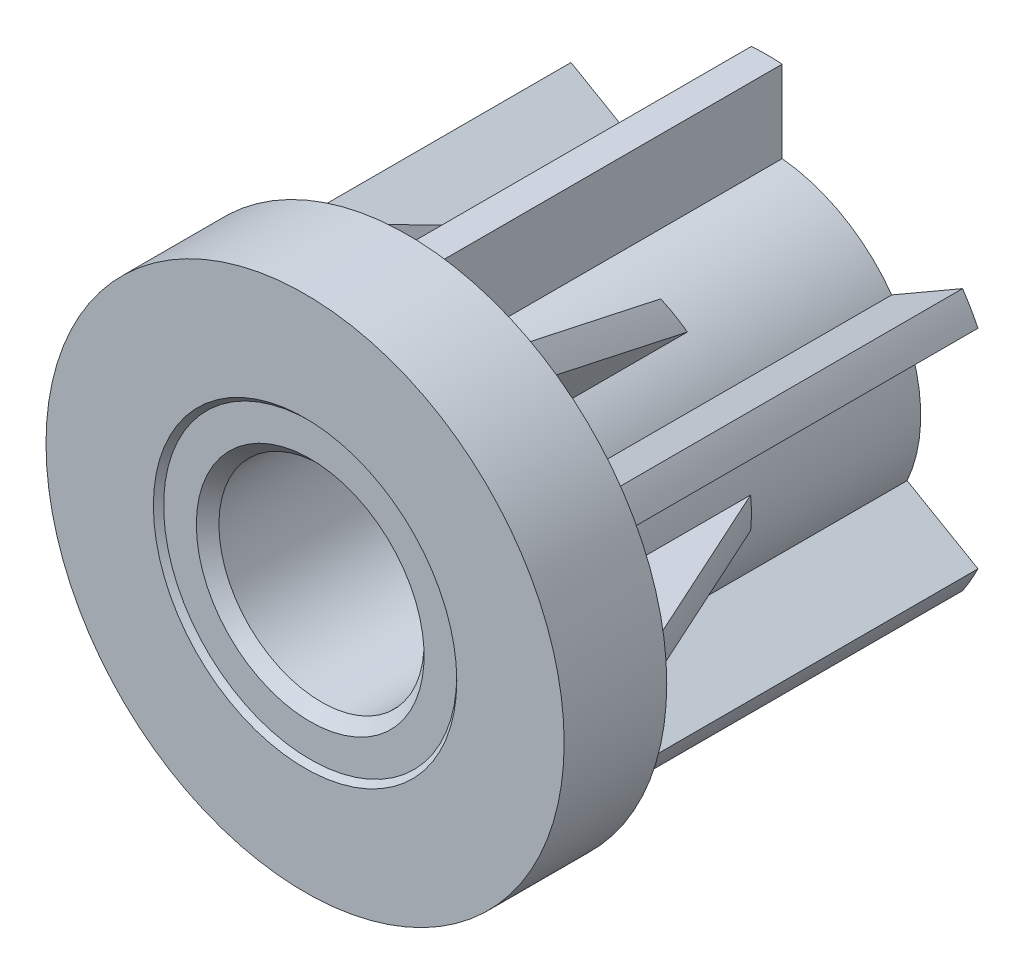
ISO-10303-21;
HEADER;
FILE_DESCRIPTION(('STEP AP214'),'2;1');
FILE_NAME('part.step','',(''),(''),'','','');
FILE_SCHEMA(('AUTOMOTIVE_DESIGN { 1 0 10303 214 1 1 1 1 }'));
ENDSEC;
DATA;
#1=APPLICATION_CONTEXT('core data for automotive mechanical design processes');
#2=APPLICATION_PROTOCOL_DEFINITION('international standard','automotive_design',2000,#1);
#3=PRODUCT_CONTEXT('',#1,'mechanical');
#4=PRODUCT('Part','Part','',(#3));
#5=PRODUCT_RELATED_PRODUCT_CATEGORY('part','',(#4));
#6=PRODUCT_DEFINITION_FORMATION('','',#4);
#7=PRODUCT_DEFINITION_CONTEXT('part definition',#1,'design');
#8=PRODUCT_DEFINITION('design','',#6,#7);
#9=PRODUCT_DEFINITION_SHAPE('','',#8);
#10=(LENGTH_UNIT() NAMED_UNIT(*) SI_UNIT(.MILLI.,.METRE.));
#11=(NAMED_UNIT(*) PLANE_ANGLE_UNIT() SI_UNIT($,.RADIAN.));
#12=(NAMED_UNIT(*) SI_UNIT($,.STERADIAN.) SOLID_ANGLE_UNIT());
#13=UNCERTAINTY_MEASURE_WITH_UNIT(LENGTH_MEASURE(1.E-05),#10,'distance_accuracy_value','');
#14=(GEOMETRIC_REPRESENTATION_CONTEXT(3) GLOBAL_UNCERTAINTY_ASSIGNED_CONTEXT((#13)) GLOBAL_UNIT_ASSIGNED_CONTEXT((#10,
#11,#12)) REPRESENTATION_CONTEXT('',''));
#15=CARTESIAN_POINT('',(0.,0.,0.));
#16=DIRECTION('',(0.,0.,1.));
#17=DIRECTION('',(1.,0.,0.));
#18=AXIS2_PLACEMENT_3D('',#15,#16,#17);
#19=CARTESIAN_POINT('',(0.,0.,-15.));
#20=DIRECTION('',(0.,0.,-1.));
#21=DIRECTION('',(-1.,0.,0.));
#22=AXIS2_PLACEMENT_3D('',#19,#20,#21);
#23=CYLINDRICAL_SURFACE('',#22,11.25);
#24=CARTESIAN_POINT('',(0.,0.,-20.));
#25=DIRECTION('',(0.,0.,-1.));
#26=DIRECTION('',(-1.,0.,0.));
#27=AXIS2_PLACEMENT_3D('',#24,#25,#26);
#28=CIRCLE('',#27,11.25);
#29=CARTESIAN_POINT('',(-11.25,0.,-20.));
#30=VERTEX_POINT('',#29);
#31=EDGE_CURVE('E1486',#30,#30,#28,.T.);
#32=ORIENTED_EDGE('',*,*,#31,.T.);
#33=EDGE_LOOP('',(#32));
#34=FACE_BOUND('',#33,.T.);
#35=CARTESIAN_POINT('',(0.,0.,-10.));
#36=DIRECTION('',(0.,0.,-1.));
#37=DIRECTION('',(-1.,0.,0.));
#38=AXIS2_PLACEMENT_3D('',#35,#36,#37);
#39=CIRCLE('',#38,11.25);
#40=CARTESIAN_POINT('',(-11.25,0.,-10.));
#41=VERTEX_POINT('',#40);
#42=EDGE_CURVE('E1489',#41,#41,#39,.F.);
#43=ORIENTED_EDGE('',*,*,#42,.T.);
#44=EDGE_LOOP('',(#43));
#45=FACE_BOUND('',#44,.T.);
#46=ADVANCED_FACE('F14',(#34,#45),#23,.F.);
#47=CARTESIAN_POINT('',(0.,10.625,-10.));
#48=DIRECTION('',(0.,0.,1.));
#49=DIRECTION('',(1.,0.,0.));
#50=AXIS2_PLACEMENT_3D('',#47,#48,#49);
#51=PLANE('',#50);
#52=ORIENTED_EDGE('',*,*,#42,.F.);
#53=EDGE_LOOP('',(#52));
#54=FACE_BOUND('',#53,.T.);
#55=CARTESIAN_POINT('',(0.,0.,-10.));
#56=DIRECTION('',(0.,0.,-1.));
#57=DIRECTION('',(-1.,0.,0.));
#58=AXIS2_PLACEMENT_3D('',#55,#56,#57);
#59=CIRCLE('',#58,10.);
#60=CARTESIAN_POINT('',(-10.,0.,-10.));
#61=VERTEX_POINT('',#60);
#62=EDGE_CURVE('E1481',#61,#61,#59,.F.);
#63=ORIENTED_EDGE('',*,*,#62,.T.);
#64=EDGE_LOOP('',(#63));
#65=FACE_BOUND('',#64,.T.);
#66=ADVANCED_FACE('F1408',(#54,#65),#51,.F.);
#67=CARTESIAN_POINT('',(0.,11.875,-20.));
#68=DIRECTION('',(0.,0.,1.));
#69=DIRECTION('',(1.,0.,0.));
#70=AXIS2_PLACEMENT_3D('',#67,#68,#69);
#71=PLANE('',#70);
#72=CARTESIAN_POINT('',(0.,0.,-20.));
#73=DIRECTION('',(0.,0.,-1.));
#74=DIRECTION('',(-1.,0.,0.));
#75=AXIS2_PLACEMENT_3D('',#72,#73,#74);
#76=CIRCLE('',#75,12.5);
#77=CARTESIAN_POINT('',(-12.5,0.,-20.));
#78=VERTEX_POINT('',#77);
#79=EDGE_CURVE('E1478',#78,#78,#76,.T.);
#80=ORIENTED_EDGE('',*,*,#79,.T.);
#81=EDGE_LOOP('',(#80));
#82=FACE_BOUND('',#81,.T.);
#83=ORIENTED_EDGE('',*,*,#31,.F.);
#84=EDGE_LOOP('',(#83));
#85=FACE_BOUND('',#84,.T.);
#86=ADVANCED_FACE('F1417',(#82,#85),#71,.F.);
#87=CARTESIAN_POINT('',(0.,0.,-27.5));
#88=DIRECTION('',(0.,0.,-1.));
#89=DIRECTION('',(-1.,0.,0.));
#90=AXIS2_PLACEMENT_3D('',#87,#88,#89);
#91=CYLINDRICAL_SURFACE('',#90,12.5);
#92=ORIENTED_EDGE('',*,*,#79,.F.);
#93=EDGE_LOOP('',(#92));
#94=FACE_BOUND('',#93,.T.);
#95=CARTESIAN_POINT('',(0.,0.,-35.));
#96=DIRECTION('',(0.,0.,-1.));
#97=DIRECTION('',(-1.,0.,0.));
#98=AXIS2_PLACEMENT_3D('',#95,#96,#97);
#99=CIRCLE('',#98,12.5);
#100=CARTESIAN_POINT('',(-12.5,0.,-35.));
#101=VERTEX_POINT('',#100);
#102=EDGE_CURVE('E358',#101,#101,#99,.F.);
#103=ORIENTED_EDGE('',*,*,#102,.F.);
#104=EDGE_LOOP('',(#103));
#105=FACE_BOUND('',#104,.T.);
#106=ADVANCED_FACE('F1427',(#94,#105),#91,.F.);
#107=CARTESIAN_POINT('',(0.,0.,-1.));
#108=DIRECTION('',(0.,0.,1.));
#109=DIRECTION('',(1.,0.,0.));
#110=AXIS2_PLACEMENT_3D('',#107,#108,#109);
#111=CONICAL_SURFACE('',#110,22.95,0.426412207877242);
#112=CARTESIAN_POINT('',(-22.900927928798,-1.5,-1.));
#113=CARTESIAN_POINT('',(-22.2368742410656,-1.5,-2.45861707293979));
#114=CARTESIAN_POINT('',(-21.5727264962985,-1.5,-3.91719133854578));
#115=CARTESIAN_POINT('',(-20.2441600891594,-1.5,-6.8342163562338));
#116=CARTESIAN_POINT('',(-19.579741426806,-1.5,-8.29266710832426));
#117=CARTESIAN_POINT('',(-18.2505502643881,-1.5,-11.2094074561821));
#118=CARTESIAN_POINT('',(-17.5857777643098,-1.5,-12.6676970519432));
#119=CARTESIAN_POINT('',(-16.255719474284,-1.5,-15.5840422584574));
#120=CARTESIAN_POINT('',(-15.5904336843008,-1.5,-17.0420978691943));
#121=CARTESIAN_POINT('',(-14.9248115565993,-1.5,-18.5));
#122=B_SPLINE_CURVE_WITH_KNOTS('',3,(#112,#113,#114,#115,#116,#117,#118,#119,#120,#121),
.UNSPECIFIED.,.F.,.F.,(4,2,2,2,4),(0.,4.80799123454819,9.61598214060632,14.4239732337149,
19.2319646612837),.UNSPECIFIED.);
#123=CARTESIAN_POINT('',(-22.900927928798,-1.5,-1.));
#124=VERTEX_POINT('',#123);
#125=CARTESIAN_POINT('',(-14.9248115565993,-1.5,-18.5));
#126=VERTEX_POINT('',#125);
#127=EDGE_CURVE('E761',#124,#126,#122,.T.);
#128=ORIENTED_EDGE('',*,*,#127,.F.);
#129=CARTESIAN_POINT('',(1.15481948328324E-12,3.19778738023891E-13,-1.));
#130=DIRECTION('',(0.,0.,1.));
#131=DIRECTION('',(1.,0.,0.));
#132=AXIS2_PLACEMENT_3D('',#129,#130,#131);
#133=CIRCLE('',#132,22.9500000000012);
#134=CARTESIAN_POINT('',(-22.9009279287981,1.5,-1.));
#135=VERTEX_POINT('',#134);
#136=EDGE_CURVE('E440',#135,#124,#133,.T.);
#137=ORIENTED_EDGE('',*,*,#136,.F.);
#138=CARTESIAN_POINT('',(-14.9248115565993,1.5,-18.5));
#139=CARTESIAN_POINT('',(-15.5904336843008,1.5,-17.0420978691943));
#140=CARTESIAN_POINT('',(-16.255719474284,1.5,-15.5840422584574));
#141=CARTESIAN_POINT('',(-17.5857777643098,1.5,-12.6676970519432));
#142=CARTESIAN_POINT('',(-18.2505502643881,1.5,-11.2094074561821));
#143=CARTESIAN_POINT('',(-19.579741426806,1.5,-8.29266710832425));
#144=CARTESIAN_POINT('',(-20.2441600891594,1.5,-6.8342163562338));
#145=CARTESIAN_POINT('',(-21.5727264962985,1.5,-3.91719133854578));
#146=CARTESIAN_POINT('',(-22.2368742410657,1.5,-2.45861707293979));
#147=CARTESIAN_POINT('',(-22.900927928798,1.5,-0.999999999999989));
#148=B_SPLINE_CURVE_WITH_KNOTS('',3,(#138,#139,#140,#141,#142,#143,#144,#145,#146,#147),
.UNSPECIFIED.,.F.,.F.,(4,2,2,2,4),(0.,4.80799142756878,9.61598252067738,14.4239734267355,
19.2319646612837),.UNSPECIFIED.);
#149=CARTESIAN_POINT('',(-14.9248115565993,1.5,-18.5));
#150=VERTEX_POINT('',#149);
#151=EDGE_CURVE('E337',#150,#135,#148,.T.);
#152=ORIENTED_EDGE('',*,*,#151,.F.);
#153=CARTESIAN_POINT('',(0.,0.,-18.5));
#154=DIRECTION('',(0.,0.,-1.));
#155=DIRECTION('',(-1.,0.,0.));
#156=AXIS2_PLACEMENT_3D('',#153,#154,#155);
#157=CIRCLE('',#156,15.);
#158=EDGE_CURVE('E435',#126,#150,#157,.T.);
#159=ORIENTED_EDGE('',*,*,#158,.F.);
#160=EDGE_LOOP('',(#128,#137,#152,#159));
#161=FACE_BOUND('',#160,.T.);
#162=ADVANCED_FACE('F707',(#161),#111,.T.);
#163=CARTESIAN_POINT('',(0.,0.,-1.));
#164=DIRECTION('',(0.,0.,1.));
#165=DIRECTION('',(1.,0.,0.));
#166=AXIS2_PLACEMENT_3D('',#163,#164,#165);
#167=CONICAL_SURFACE('',#166,22.95,0.426412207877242);
#168=CARTESIAN_POINT('',(-10.1514258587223,-20.5827853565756,-1.));
#169=CARTESIAN_POINT('',(-9.81939901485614,-20.0076979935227,-2.45861707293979));
#170=CARTESIAN_POINT('',(-9.48732514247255,-19.4325291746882,-3.91719133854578));
#171=CARTESIAN_POINT('',(-8.82304193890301,-18.2819569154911,-6.83421635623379));
#172=CARTESIAN_POINT('',(-8.49083260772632,-17.7065534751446,-8.29266710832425));
#173=CARTESIAN_POINT('',(-7.82623702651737,-16.5554401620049,-11.2094074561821));
#174=CARTESIAN_POINT('',(-7.49385077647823,-15.9797302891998,-12.6676970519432));
#175=CARTESIAN_POINT('',(-6.82882163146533,-14.8278660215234,-15.5840422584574));
#176=CARTESIAN_POINT('',(-6.49617873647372,-14.2517116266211,-17.0420978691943));
#177=CARTESIAN_POINT('',(-6.16336767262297,-13.6752659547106,-18.5));
#178=B_SPLINE_CURVE_WITH_KNOTS('',3,(#168,#169,#170,#171,#172,#173,#174,#175,#176,#177),
.UNSPECIFIED.,.F.,.F.,(4,2,2,2,4),(0.,4.80799123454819,9.61598214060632,14.4239732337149,
19.2319646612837),.UNSPECIFIED.);
#179=CARTESIAN_POINT('',(-10.1514258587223,-20.5827853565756,-1.));
#180=VERTEX_POINT('',#179);
#181=CARTESIAN_POINT('',(-6.16336767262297,-13.6752659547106,-18.5));
#182=VERTEX_POINT('',#181);
#183=EDGE_CURVE('E713',#180,#182,#178,.T.);
#184=ORIENTED_EDGE('',*,*,#183,.F.);
#185=CARTESIAN_POINT('',(6.91190348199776E-13,1.05141571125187E-12,-1.));
#186=DIRECTION('',(0.,0.,1.));
#187=DIRECTION('',(1.,0.,0.));
#188=AXIS2_PLACEMENT_3D('',#185,#186,#187);
#189=CIRCLE('',#188,22.9500000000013);
#190=CARTESIAN_POINT('',(-12.7495020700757,-19.0827853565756,-1.));
#191=VERTEX_POINT('',#190);
#192=EDGE_CURVE('E427',#191,#180,#189,.T.);
#193=ORIENTED_EDGE('',*,*,#192,.F.);
#194=CARTESIAN_POINT('',(-8.7614438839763,-12.1752659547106,-18.5));
#195=CARTESIAN_POINT('',(-9.09425494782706,-12.7517116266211,-17.0420978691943));
#196=CARTESIAN_POINT('',(-9.42689784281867,-13.3278660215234,-15.5840422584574));
#197=CARTESIAN_POINT('',(-10.0919269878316,-14.4797302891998,-12.6676970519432));
#198=CARTESIAN_POINT('',(-10.4243132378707,-15.0554401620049,-11.2094074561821));
#199=CARTESIAN_POINT('',(-11.0889088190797,-16.2065534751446,-8.29266710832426));
#200=CARTESIAN_POINT('',(-11.4211181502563,-16.7819569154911,-6.8342163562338));
#201=CARTESIAN_POINT('',(-12.0854013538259,-17.9325291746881,-3.91719133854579));
#202=CARTESIAN_POINT('',(-12.4174752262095,-18.5076979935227,-2.4586170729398));
#203=CARTESIAN_POINT('',(-12.7495020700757,-19.0827853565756,-1.));
#204=B_SPLINE_CURVE_WITH_KNOTS('',3,(#194,#195,#196,#197,#198,#199,#200,#201,#202,#203),
.UNSPECIFIED.,.F.,.F.,(4,2,2,2,4),(0.,4.80799142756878,9.61598252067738,14.4239734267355,
19.2319646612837),.UNSPECIFIED.);
#205=CARTESIAN_POINT('',(-8.76144388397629,-12.1752659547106,-18.5));
#206=VERTEX_POINT('',#205);
#207=EDGE_CURVE('E425',#206,#191,#204,.T.);
#208=ORIENTED_EDGE('',*,*,#207,.F.);
#209=CARTESIAN_POINT('',(0.,0.,-18.5));
#210=DIRECTION('',(0.,0.,-1.));
#211=DIRECTION('',(-1.,0.,0.));
#212=AXIS2_PLACEMENT_3D('',#209,#210,#211);
#213=CIRCLE('',#212,15.);
#214=EDGE_CURVE('E418',#182,#206,#213,.T.);
#215=ORIENTED_EDGE('',*,*,#214,.F.);
#216=EDGE_LOOP('',(#184,#193,#208,#215));
#217=FACE_BOUND('',#216,.T.);
#218=ADVANCED_FACE('F701',(#217),#167,.T.);
#219=CARTESIAN_POINT('',(0.,0.,-0.999999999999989));
#220=DIRECTION('',(0.,0.,1.));
#221=DIRECTION('',(1.,0.,0.));
#222=AXIS2_PLACEMENT_3D('',#219,#220,#221);
#223=CONICAL_SURFACE('',#222,22.95,0.426412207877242);
#224=CARTESIAN_POINT('',(12.7495020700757,-19.0827853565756,-1.));
#225=CARTESIAN_POINT('',(12.4174752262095,-18.5076979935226,-2.45861707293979));
#226=CARTESIAN_POINT('',(12.0854013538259,-17.9325291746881,-3.91719133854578));
#227=CARTESIAN_POINT('',(11.4211181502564,-16.7819569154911,-6.8342163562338));
#228=CARTESIAN_POINT('',(11.0889088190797,-16.2065534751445,-8.29266710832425));
#229=CARTESIAN_POINT('',(10.4243132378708,-15.0554401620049,-11.2094074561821));
#230=CARTESIAN_POINT('',(10.0919269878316,-14.4797302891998,-12.6676970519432));
#231=CARTESIAN_POINT('',(9.42689784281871,-13.3278660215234,-15.5840422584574));
#232=CARTESIAN_POINT('',(9.0942549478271,-12.7517116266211,-17.0420978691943));
#233=CARTESIAN_POINT('',(8.76144388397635,-12.1752659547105,-18.5));
#234=B_SPLINE_CURVE_WITH_KNOTS('',3,(#224,#225,#226,#227,#228,#229,#230,#231,#232,#233),
.UNSPECIFIED.,.F.,.F.,(4,2,2,2,4),(0.,4.80799123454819,9.61598214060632,14.4239732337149,
19.2319646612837),.UNSPECIFIED.);
#235=CARTESIAN_POINT('',(12.7495020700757,-19.0827853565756,-1.));
#236=VERTEX_POINT('',#235);
#237=CARTESIAN_POINT('',(8.76144388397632,-12.1752659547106,-18.5));
#238=VERTEX_POINT('',#237);
#239=EDGE_CURVE('E684',#236,#238,#234,.T.);
#240=ORIENTED_EDGE('',*,*,#239,.F.);
#241=CARTESIAN_POINT('',(-3.49754759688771E-13,0.,-1.));
#242=DIRECTION('',(0.,0.,1.));
#243=DIRECTION('',(1.,0.,0.));
#244=AXIS2_PLACEMENT_3D('',#241,#242,#243);
#245=CIRCLE('',#244,22.95);
#246=CARTESIAN_POINT('',(10.1514258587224,-20.5827853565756,-1.));
#247=VERTEX_POINT('',#246);
#248=EDGE_CURVE('E410',#247,#236,#245,.T.);
#249=ORIENTED_EDGE('',*,*,#248,.F.);
#250=CARTESIAN_POINT('',(6.16336767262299,-13.6752659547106,-18.5));
#251=CARTESIAN_POINT('',(6.49617873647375,-14.2517116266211,-17.0420978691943));
#252=CARTESIAN_POINT('',(6.82882163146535,-14.8278660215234,-15.5840422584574));
#253=CARTESIAN_POINT('',(7.49385077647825,-15.9797302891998,-12.6676970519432));
#254=CARTESIAN_POINT('',(7.82623702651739,-16.5554401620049,-11.2094074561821));
#255=CARTESIAN_POINT('',(8.49083260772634,-17.7065534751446,-8.29266710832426));
#256=CARTESIAN_POINT('',(8.82304193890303,-18.2819569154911,-6.8342163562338));
#257=CARTESIAN_POINT('',(9.48732514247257,-19.4325291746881,-3.91719133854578));
#258=CARTESIAN_POINT('',(9.81939901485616,-20.0076979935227,-2.45861707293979));
#259=CARTESIAN_POINT('',(10.1514258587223,-20.5827853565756,-1.));
#260=B_SPLINE_CURVE_WITH_KNOTS('',3,(#250,#251,#252,#253,#254,#255,#256,#257,#258,#259),
.UNSPECIFIED.,.F.,.F.,(4,2,2,2,4),(0.,4.80799142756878,9.61598252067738,14.4239734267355,
19.2319646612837),.UNSPECIFIED.);
#261=CARTESIAN_POINT('',(6.16336767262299,-13.6752659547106,-18.5));
#262=VERTEX_POINT('',#261);
#263=EDGE_CURVE('E408',#262,#247,#260,.T.);
#264=ORIENTED_EDGE('',*,*,#263,.F.);
#265=CARTESIAN_POINT('',(0.,0.,-18.5));
#266=DIRECTION('',(0.,0.,-1.));
#267=DIRECTION('',(-1.,0.,0.));
#268=AXIS2_PLACEMENT_3D('',#265,#266,#267);
#269=CIRCLE('',#268,15.);
#270=EDGE_CURVE('E401',#238,#262,#269,.T.);
#271=ORIENTED_EDGE('',*,*,#270,.F.);
#272=EDGE_LOOP('',(#240,#249,#264,#271));
#273=FACE_BOUND('',#272,.T.);
#274=ADVANCED_FACE('F697',(#273),#223,.T.);
#275=CARTESIAN_POINT('',(0.,0.,-0.999999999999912));
#276=DIRECTION('',(0.,0.,1.));
#277=DIRECTION('',(1.,0.,0.));
#278=AXIS2_PLACEMENT_3D('',#275,#276,#277);
#279=CONICAL_SURFACE('',#278,22.95,0.426412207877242);
#280=CARTESIAN_POINT('',(14.9248115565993,-1.5,-18.5));
#281=CARTESIAN_POINT('',(15.5904336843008,-1.5,-17.0420978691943));
#282=CARTESIAN_POINT('',(16.255719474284,-1.50000000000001,-15.5840422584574));
#283=CARTESIAN_POINT('',(17.5857777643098,-1.50000000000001,-12.6676970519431));
#284=CARTESIAN_POINT('',(18.2505502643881,-1.50000000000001,-11.209407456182));
#285=CARTESIAN_POINT('',(19.579741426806,-1.50000000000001,-8.29266710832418));
#286=CARTESIAN_POINT('',(20.2441600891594,-1.50000000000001,-6.83421635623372));
#287=CARTESIAN_POINT('',(21.5727264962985,-1.5,-3.91719133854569));
#288=CARTESIAN_POINT('',(22.2368742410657,-1.5,-2.4586170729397));
#289=CARTESIAN_POINT('',(22.9009279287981,-1.5,-0.999999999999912));
#290=B_SPLINE_CURVE_WITH_KNOTS('',3,(#280,#281,#282,#283,#284,#285,#286,#287,#288,#289),
.UNSPECIFIED.,.F.,.F.,(4,2,2,2,4),(0.,4.80799142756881,9.61598252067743,14.4239734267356,
19.2319646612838),.UNSPECIFIED.);
#291=CARTESIAN_POINT('',(14.9248115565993,-1.5,-18.5));
#292=VERTEX_POINT('',#291);
#293=CARTESIAN_POINT('',(22.9009279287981,-1.5,-0.999999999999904));
#294=VERTEX_POINT('',#293);
#295=EDGE_CURVE('E386',#292,#294,#290,.T.);
#296=ORIENTED_EDGE('',*,*,#295,.F.);
#297=CARTESIAN_POINT('',(0.,0.,-18.5));
#298=DIRECTION('',(0.,0.,-1.));
#299=DIRECTION('',(-1.,0.,0.));
#300=AXIS2_PLACEMENT_3D('',#297,#298,#299);
#301=CIRCLE('',#300,15.);
#302=CARTESIAN_POINT('',(14.9248115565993,1.5,-18.5));
#303=VERTEX_POINT('',#302);
#304=EDGE_CURVE('E388',#303,#292,#301,.T.);
#305=ORIENTED_EDGE('',*,*,#304,.F.);
#306=CARTESIAN_POINT('',(22.900927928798,1.5,-0.999999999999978));
#307=CARTESIAN_POINT('',(22.2368742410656,1.5,-2.45861707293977));
#308=CARTESIAN_POINT('',(21.5727264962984,1.5,-3.91719133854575));
#309=CARTESIAN_POINT('',(20.2441600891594,1.5,-6.83421635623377));
#310=CARTESIAN_POINT('',(19.579741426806,1.5,-8.29266710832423));
#311=CARTESIAN_POINT('',(18.2505502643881,1.5,-11.2094074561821));
#312=CARTESIAN_POINT('',(17.5857777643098,1.5,-12.6676970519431));
#313=CARTESIAN_POINT('',(16.255719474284,1.5,-15.5840422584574));
#314=CARTESIAN_POINT('',(15.5904336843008,1.5,-17.0420978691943));
#315=CARTESIAN_POINT('',(14.9248115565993,1.5,-18.5));
#316=B_SPLINE_CURVE_WITH_KNOTS('',3,(#306,#307,#308,#309,#310,#311,#312,#313,#314,#315),
.UNSPECIFIED.,.F.,.F.,(4,2,2,2,4),(0.,4.80799123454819,9.61598214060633,14.4239732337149,
19.2319646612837),.UNSPECIFIED.);
#317=CARTESIAN_POINT('',(22.900927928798,1.5,-0.999999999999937));
#318=VERTEX_POINT('',#317);
#319=EDGE_CURVE('E639',#318,#303,#316,.T.);
#320=ORIENTED_EDGE('',*,*,#319,.F.);
#321=CARTESIAN_POINT('',(-2.98240411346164E-13,-2.2045578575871E-13,-0.9999999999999));
#322=DIRECTION('',(0.,0.,1.));
#323=DIRECTION('',(1.,0.,0.));
#324=AXIS2_PLACEMENT_3D('',#321,#322,#323);
#325=CIRCLE('',#324,22.9500000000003);
#326=EDGE_CURVE('E393',#294,#318,#325,.T.);
#327=ORIENTED_EDGE('',*,*,#326,.F.);
#328=EDGE_LOOP('',(#296,#305,#320,#327));
#329=FACE_BOUND('',#328,.T.);
#330=ADVANCED_FACE('F585',(#329),#279,.T.);
#331=CARTESIAN_POINT('',(0.,0.,-1.));
#332=DIRECTION('',(0.,0.,1.));
#333=DIRECTION('',(1.,0.,0.));
#334=AXIS2_PLACEMENT_3D('',#331,#332,#333);
#335=CONICAL_SURFACE('',#334,22.95,0.426412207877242);
#336=CARTESIAN_POINT('',(10.1514258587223,20.5827853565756,-1.00000000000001));
#337=CARTESIAN_POINT('',(9.81939901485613,20.0076979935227,-2.45861707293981));
#338=CARTESIAN_POINT('',(9.48732514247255,19.4325291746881,-3.9171913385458));
#339=CARTESIAN_POINT('',(8.82304193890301,18.2819569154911,-6.83421635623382));
#340=CARTESIAN_POINT('',(8.49083260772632,17.7065534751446,-8.29266710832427));
#341=CARTESIAN_POINT('',(7.82623702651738,16.5554401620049,-11.2094074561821));
#342=CARTESIAN_POINT('',(7.49385077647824,15.9797302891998,-12.6676970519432));
#343=CARTESIAN_POINT('',(6.82882163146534,14.8278660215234,-15.5840422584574));
#344=CARTESIAN_POINT('',(6.49617873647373,14.2517116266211,-17.0420978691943));
#345=CARTESIAN_POINT('',(6.16336767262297,13.6752659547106,-18.5));
#346=B_SPLINE_CURVE_WITH_KNOTS('',3,(#336,#337,#338,#339,#340,#341,#342,#343,#344,#345),
.UNSPECIFIED.,.F.,.F.,(4,2,2,2,4),(0.,4.80799123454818,9.61598214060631,14.4239732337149,
19.2319646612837),.UNSPECIFIED.);
#347=CARTESIAN_POINT('',(10.1514258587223,20.5827853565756,-1.));
#348=VERTEX_POINT('',#347);
#349=CARTESIAN_POINT('',(6.16336767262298,13.6752659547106,-18.5));
#350=VERTEX_POINT('',#349);
#351=EDGE_CURVE('E591',#348,#350,#346,.T.);
#352=ORIENTED_EDGE('',*,*,#351,.F.);
#353=CARTESIAN_POINT('',(-1.13499300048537E-13,3.62189257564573E-13,-1.));
#354=DIRECTION('',(0.,0.,1.));
#355=DIRECTION('',(1.,0.,0.));
#356=AXIS2_PLACEMENT_3D('',#353,#354,#355);
#357=CIRCLE('',#356,22.9499999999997);
#358=CARTESIAN_POINT('',(12.7495020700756,19.0827853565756,-1.));
#359=VERTEX_POINT('',#358);
#360=EDGE_CURVE('E376',#359,#348,#357,.T.);
#361=ORIENTED_EDGE('',*,*,#360,.F.);
#362=CARTESIAN_POINT('',(8.76144388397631,12.1752659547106,-18.5));
#363=CARTESIAN_POINT('',(9.09425494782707,12.7517116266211,-17.0420978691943));
#364=CARTESIAN_POINT('',(9.42689784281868,13.3278660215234,-15.5840422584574));
#365=CARTESIAN_POINT('',(10.0919269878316,14.4797302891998,-12.6676970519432));
#366=CARTESIAN_POINT('',(10.4243132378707,15.0554401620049,-11.2094074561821));
#367=CARTESIAN_POINT('',(11.0889088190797,16.2065534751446,-8.29266710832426));
#368=CARTESIAN_POINT('',(11.4211181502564,16.7819569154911,-6.83421635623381));
#369=CARTESIAN_POINT('',(12.0854013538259,17.9325291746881,-3.91719133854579));
#370=CARTESIAN_POINT('',(12.4174752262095,18.5076979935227,-2.4586170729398));
#371=CARTESIAN_POINT('',(12.7495020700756,19.0827853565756,-1.));
#372=B_SPLINE_CURVE_WITH_KNOTS('',3,(#362,#363,#364,#365,#366,#367,#368,#369,#370,#371),
.UNSPECIFIED.,.F.,.F.,(4,2,2,2,4),(0.,4.80799142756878,9.61598252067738,14.4239734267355,
19.2319646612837),.UNSPECIFIED.);
#373=CARTESIAN_POINT('',(8.7614438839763,12.1752659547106,-18.5));
#374=VERTEX_POINT('',#373);
#375=EDGE_CURVE('E369',#374,#359,#372,.T.);
#376=ORIENTED_EDGE('',*,*,#375,.F.);
#377=CARTESIAN_POINT('',(0.,0.,-18.5));
#378=DIRECTION('',(0.,0.,-1.));
#379=DIRECTION('',(-1.,0.,0.));
#380=AXIS2_PLACEMENT_3D('',#377,#378,#379);
#381=CIRCLE('',#380,15.);
#382=EDGE_CURVE('E371',#350,#374,#381,.T.);
#383=ORIENTED_EDGE('',*,*,#382,.F.);
#384=EDGE_LOOP('',(#352,#361,#376,#383));
#385=FACE_BOUND('',#384,.T.);
#386=ADVANCED_FACE('F578',(#385),#335,.T.);
#387=CARTESIAN_POINT('',(0.,0.,-0.999999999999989));
#388=DIRECTION('',(0.,0.,1.));
#389=DIRECTION('',(1.,0.,0.));
#390=AXIS2_PLACEMENT_3D('',#387,#388,#389);
#391=CONICAL_SURFACE('',#390,22.95,0.426412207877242);
#392=CARTESIAN_POINT('',(-12.7495020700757,19.0827853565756,-1.));
#393=CARTESIAN_POINT('',(-12.4174752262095,18.5076979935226,-2.45861707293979));
#394=CARTESIAN_POINT('',(-12.0854013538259,17.9325291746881,-3.91719133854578));
#395=CARTESIAN_POINT('',(-11.4211181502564,16.7819569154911,-6.83421635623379));
#396=CARTESIAN_POINT('',(-11.0889088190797,16.2065534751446,-8.29266710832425));
#397=CARTESIAN_POINT('',(-10.4243132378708,15.0554401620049,-11.2094074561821));
#398=CARTESIAN_POINT('',(-10.0919269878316,14.4797302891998,-12.6676970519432));
#399=CARTESIAN_POINT('',(-9.42689784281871,13.3278660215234,-15.5840422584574));
#400=CARTESIAN_POINT('',(-9.0942549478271,12.7517116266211,-17.0420978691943));
#401=CARTESIAN_POINT('',(-8.76144388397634,12.1752659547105,-18.5));
#402=B_SPLINE_CURVE_WITH_KNOTS('',3,(#392,#393,#394,#395,#396,#397,#398,#399,#400,#401),
.UNSPECIFIED.,.F.,.F.,(4,2,2,2,4),(0.,4.80799123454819,9.61598214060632,14.4239732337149,
19.2319646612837),.UNSPECIFIED.);
#403=CARTESIAN_POINT('',(-12.7495020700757,19.0827853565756,-1.));
#404=VERTEX_POINT('',#403);
#405=CARTESIAN_POINT('',(-8.76144388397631,12.1752659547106,-18.5));
#406=VERTEX_POINT('',#405);
#407=EDGE_CURVE('E554',#404,#406,#402,.T.);
#408=ORIENTED_EDGE('',*,*,#407,.F.);
#409=CARTESIAN_POINT('',(6.16583360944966E-13,-1.37508773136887E-12,-1.));
#410=DIRECTION('',(0.,0.,1.));
#411=DIRECTION('',(1.,0.,0.));
#412=AXIS2_PLACEMENT_3D('',#409,#410,#411);
#413=CIRCLE('',#412,22.9500000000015);
#414=CARTESIAN_POINT('',(-10.1514258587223,20.5827853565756,-1.));
#415=VERTEX_POINT('',#414);
#416=EDGE_CURVE('E359',#415,#404,#413,.T.);
#417=ORIENTED_EDGE('',*,*,#416,.F.);
#418=CARTESIAN_POINT('',(-6.16336767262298,13.6752659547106,-18.5));
#419=CARTESIAN_POINT('',(-6.49617873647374,14.2517116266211,-17.0420978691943));
#420=CARTESIAN_POINT('',(-6.82882163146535,14.8278660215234,-15.5840422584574));
#421=CARTESIAN_POINT('',(-7.49385077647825,15.9797302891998,-12.6676970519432));
#422=CARTESIAN_POINT('',(-7.82623702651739,16.5554401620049,-11.2094074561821));
#423=CARTESIAN_POINT('',(-8.49083260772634,17.7065534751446,-8.29266710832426));
#424=CARTESIAN_POINT('',(-8.82304193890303,18.2819569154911,-6.83421635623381));
#425=CARTESIAN_POINT('',(-9.48732514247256,19.4325291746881,-3.91719133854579));
#426=CARTESIAN_POINT('',(-9.81939901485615,20.0076979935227,-2.4586170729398));
#427=CARTESIAN_POINT('',(-10.1514258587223,20.5827853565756,-1.));
#428=B_SPLINE_CURVE_WITH_KNOTS('',3,(#418,#419,#420,#421,#422,#423,#424,#425,#426,#427),
.UNSPECIFIED.,.F.,.F.,(4,2,2,2,4),(0.,4.80799142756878,9.61598252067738,14.4239734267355,
19.2319646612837),.UNSPECIFIED.);
#429=CARTESIAN_POINT('',(-6.16336767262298,13.6752659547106,-18.5));
#430=VERTEX_POINT('',#429);
#431=EDGE_CURVE('E351',#430,#415,#428,.T.);
#432=ORIENTED_EDGE('',*,*,#431,.F.);
#433=CARTESIAN_POINT('',(0.,0.,-18.5));
#434=DIRECTION('',(0.,0.,-1.));
#435=DIRECTION('',(-1.,0.,0.));
#436=AXIS2_PLACEMENT_3D('',#433,#434,#435);
#437=CIRCLE('',#436,15.);
#438=EDGE_CURVE('E353',#406,#430,#437,.T.);
#439=ORIENTED_EDGE('',*,*,#438,.F.);
#440=EDGE_LOOP('',(#408,#417,#432,#439));
#441=FACE_BOUND('',#440,.T.);
#442=ADVANCED_FACE('F573',(#441),#391,.T.);
#443=CARTESIAN_POINT('',(0.,7.5,-35.));
#444=DIRECTION('',(0.,0.,-1.));
#445=DIRECTION('',(-1.,0.,0.));
#446=AXIS2_PLACEMENT_3D('',#443,#444,#445);
#447=PLANE('',#446);
#448=CARTESIAN_POINT('',(1.27356083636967E-13,0.,-35.));
#449=DIRECTION('',(0.,0.,1.));
#450=DIRECTION('',(1.,0.,0.));
#451=AXIS2_PLACEMENT_3D('',#448,#449,#450);
#452=CIRCLE('',#451,22.95);
#453=CARTESIAN_POINT('',(-19.0827853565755,12.7495020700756,-35.));
#454=VERTEX_POINT('',#453);
#455=CARTESIAN_POINT('',(-20.5827853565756,10.1514258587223,-35.));
#456=VERTEX_POINT('',#455);
#457=EDGE_CURVE('E319',#454,#456,#452,.T.);
#458=ORIENTED_EDGE('',*,*,#457,.F.);
#459=DIRECTION('',(0.866025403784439,-0.5,0.));
#460=VECTOR('',#459,1.);
#461=CARTESIAN_POINT('',(-6.93521307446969,5.73609794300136,-35.));
#462=LINE('',#461,#460);
#463=CARTESIAN_POINT('',(-12.1752659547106,8.7614438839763,-35.));
#464=VERTEX_POINT('',#463);
#465=EDGE_CURVE('E314',#464,#454,#462,.F.);
#466=ORIENTED_EDGE('',*,*,#465,.F.);
#467=CARTESIAN_POINT('',(0.,0.,-35.));
#468=DIRECTION('',(0.,0.,-1.));
#469=DIRECTION('',(-1.,0.,0.));
#470=AXIS2_PLACEMENT_3D('',#467,#468,#469);
#471=CIRCLE('',#470,15.);
#472=CARTESIAN_POINT('',(-1.5,14.9248115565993,-35.));
#473=VERTEX_POINT('',#472);
#474=EDGE_CURVE('E550',#473,#464,#471,.F.);
#475=ORIENTED_EDGE('',*,*,#474,.F.);
#476=DIRECTION('',(0.,1.,0.));
#477=VECTOR('',#476,1.);
#478=CARTESIAN_POINT('',(-1.5,22.900927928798,-35.));
#479=LINE('',#478,#477);
#480=CARTESIAN_POINT('',(-1.5,22.900927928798,-35.));
#481=VERTEX_POINT('',#480);
#482=EDGE_CURVE('E349',#481,#473,#479,.F.);
#483=ORIENTED_EDGE('',*,*,#482,.F.);
#484=CARTESIAN_POINT('',(2.50146750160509E-13,-1.1043523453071E-12,-35.));
#485=DIRECTION('',(0.,0.,1.));
#486=DIRECTION('',(1.,0.,0.));
#487=AXIS2_PLACEMENT_3D('',#484,#485,#486);
#488=CIRCLE('',#487,22.9500000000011);
#489=CARTESIAN_POINT('',(1.5,22.900927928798,-35.));
#490=VERTEX_POINT('',#489);
#491=EDGE_CURVE('E838',#490,#481,#488,.T.);
#492=ORIENTED_EDGE('',*,*,#491,.F.);
#493=DIRECTION('',(0.,-1.,0.));
#494=VECTOR('',#493,1.);
#495=CARTESIAN_POINT('',(1.5,8.87411967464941,-35.));
#496=LINE('',#495,#494);
#497=CARTESIAN_POINT('',(1.5,14.9248115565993,-35.));
#498=VERTEX_POINT('',#497);
#499=EDGE_CURVE('E363',#498,#490,#496,.F.);
#500=ORIENTED_EDGE('',*,*,#499,.F.);
#501=CARTESIAN_POINT('',(0.,0.,-35.));
#502=DIRECTION('',(0.,0.,-1.));
#503=DIRECTION('',(-1.,0.,0.));
#504=AXIS2_PLACEMENT_3D('',#501,#502,#503);
#505=CIRCLE('',#504,15.);
#506=CARTESIAN_POINT('',(12.1752659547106,8.76144388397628,-35.));
#507=VERTEX_POINT('',#506);
#508=EDGE_CURVE('E843',#507,#498,#505,.F.);
#509=ORIENTED_EDGE('',*,*,#508,.F.);
#510=DIRECTION('',(0.866025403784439,0.5,0.));
#511=VECTOR('',#510,1.);
#512=CARTESIAN_POINT('',(19.0827853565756,12.7495020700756,-35.));
#513=LINE('',#512,#511);
#514=CARTESIAN_POINT('',(19.0827853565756,12.7495020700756,-35.));
#515=VERTEX_POINT('',#514);
#516=EDGE_CURVE('E367',#515,#507,#513,.F.);
#517=ORIENTED_EDGE('',*,*,#516,.F.);
#518=CARTESIAN_POINT('',(0.,1.95940861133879E-13,-35.));
#519=DIRECTION('',(0.,0.,1.));
#520=DIRECTION('',(1.,0.,0.));
#521=AXIS2_PLACEMENT_3D('',#518,#519,#520);
#522=CIRCLE('',#521,22.95);
#523=CARTESIAN_POINT('',(20.5827853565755,10.1514258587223,-35.));
#524=VERTEX_POINT('',#523);
#525=EDGE_CURVE('E606',#524,#515,#522,.T.);
#526=ORIENTED_EDGE('',*,*,#525,.F.);
#527=DIRECTION('',(-0.866025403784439,-0.5,0.));
#528=VECTOR('',#527,1.);
#529=CARTESIAN_POINT('',(8.43521307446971,3.13802173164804,-35.));
#530=LINE('',#529,#528);
#531=CARTESIAN_POINT('',(13.6752659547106,6.16336767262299,-35.));
#532=VERTEX_POINT('',#531);
#533=EDGE_CURVE('E380',#532,#524,#530,.F.);
#534=ORIENTED_EDGE('',*,*,#533,.F.);
#535=CARTESIAN_POINT('',(0.,0.,-35.));
#536=DIRECTION('',(0.,0.,-1.));
#537=DIRECTION('',(-1.,0.,0.));
#538=AXIS2_PLACEMENT_3D('',#535,#536,#537);
#539=CIRCLE('',#538,15.);
#540=CARTESIAN_POINT('',(13.6752659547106,-6.16336767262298,-35.));
#541=VERTEX_POINT('',#540);
#542=EDGE_CURVE('E646',#541,#532,#539,.F.);
#543=ORIENTED_EDGE('',*,*,#542,.F.);
#544=DIRECTION('',(0.866025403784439,-0.5,0.));
#545=VECTOR('',#544,1.);
#546=CARTESIAN_POINT('',(20.5827853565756,-10.1514258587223,-35.));
#547=LINE('',#546,#545);
#548=CARTESIAN_POINT('',(20.5827853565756,-10.1514258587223,-35.));
#549=VERTEX_POINT('',#548);
#550=EDGE_CURVE('E384',#549,#541,#547,.F.);
#551=ORIENTED_EDGE('',*,*,#550,.F.);
#552=CARTESIAN_POINT('',(-1.030828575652E-12,3.54036619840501E-13,-35.));
#553=DIRECTION('',(0.,0.,1.));
#554=DIRECTION('',(1.,0.,0.));
#555=AXIS2_PLACEMENT_3D('',#552,#553,#554);
#556=CIRCLE('',#555,22.9500000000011);
#557=CARTESIAN_POINT('',(19.0827853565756,-12.7495020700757,-35.));
#558=VERTEX_POINT('',#557);
#559=EDGE_CURVE('E653',#558,#549,#556,.T.);
#560=ORIENTED_EDGE('',*,*,#559,.F.);
#561=DIRECTION('',(-0.866025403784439,0.5,0.));
#562=VECTOR('',#561,1.);
#563=CARTESIAN_POINT('',(6.93521307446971,-5.73609794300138,-35.));
#564=LINE('',#563,#562);
#565=CARTESIAN_POINT('',(12.1752659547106,-8.76144388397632,-35.));
#566=VERTEX_POINT('',#565);
#567=EDGE_CURVE('E397',#566,#558,#564,.F.);
#568=ORIENTED_EDGE('',*,*,#567,.F.);
#569=CARTESIAN_POINT('',(0.,0.,-35.));
#570=DIRECTION('',(0.,0.,-1.));
#571=DIRECTION('',(-1.,0.,0.));
#572=AXIS2_PLACEMENT_3D('',#569,#570,#571);
#573=CIRCLE('',#572,15.);
#574=CARTESIAN_POINT('',(1.5,-14.9248115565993,-35.));
#575=VERTEX_POINT('',#574);
#576=EDGE_CURVE('E691',#575,#566,#573,.F.);
#577=ORIENTED_EDGE('',*,*,#576,.F.);
#578=DIRECTION('',(0.,-1.,0.));
#579=VECTOR('',#578,1.);
#580=CARTESIAN_POINT('',(1.5,-22.900927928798,-35.));
#581=LINE('',#580,#579);
#582=CARTESIAN_POINT('',(1.5,-22.900927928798,-35.));
#583=VERTEX_POINT('',#582);
#584=EDGE_CURVE('E406',#583,#575,#581,.F.);
#585=ORIENTED_EDGE('',*,*,#584,.F.);
#586=CARTESIAN_POINT('',(0.,1.0699084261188E-12,-35.));
#587=DIRECTION('',(0.,0.,1.));
#588=DIRECTION('',(1.,0.,0.));
#589=AXIS2_PLACEMENT_3D('',#586,#587,#588);
#590=CIRCLE('',#589,22.9500000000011);
#591=CARTESIAN_POINT('',(-1.5,-22.9009279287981,-35.));
#592=VERTEX_POINT('',#591);
#593=EDGE_CURVE('E889',#592,#583,#590,.T.);
#594=ORIENTED_EDGE('',*,*,#593,.F.);
#595=DIRECTION('',(0.,1.,0.));
#596=VECTOR('',#595,1.);
#597=CARTESIAN_POINT('',(-1.5,-8.87411967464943,-35.));
#598=LINE('',#597,#596);
#599=CARTESIAN_POINT('',(-1.5,-14.9248115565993,-35.));
#600=VERTEX_POINT('',#599);
#601=EDGE_CURVE('E414',#600,#592,#598,.F.);
#602=ORIENTED_EDGE('',*,*,#601,.F.);
#603=CARTESIAN_POINT('',(0.,0.,-35.));
#604=DIRECTION('',(0.,0.,-1.));
#605=DIRECTION('',(-1.,0.,0.));
#606=AXIS2_PLACEMENT_3D('',#603,#604,#605);
#607=CIRCLE('',#606,15.);
#608=CARTESIAN_POINT('',(-12.1752659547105,-8.76144388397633,-35.));
#609=VERTEX_POINT('',#608);
#610=EDGE_CURVE('E896',#609,#600,#607,.F.);
#611=ORIENTED_EDGE('',*,*,#610,.F.);
#612=DIRECTION('',(-0.866025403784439,-0.5,0.));
#613=VECTOR('',#612,1.);
#614=CARTESIAN_POINT('',(-19.0827853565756,-12.7495020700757,-35.));
#615=LINE('',#614,#613);
#616=CARTESIAN_POINT('',(-19.0827853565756,-12.7495020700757,-35.));
#617=VERTEX_POINT('',#616);
#618=EDGE_CURVE('E423',#617,#609,#615,.F.);
#619=ORIENTED_EDGE('',*,*,#618,.F.);
#620=CARTESIAN_POINT('',(-1.22978054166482E-12,-1.0972469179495E-12,-35.));
#621=DIRECTION('',(0.,0.,1.));
#622=DIRECTION('',(1.,0.,0.));
#623=AXIS2_PLACEMENT_3D('',#620,#621,#622);
#624=CIRCLE('',#623,22.9499999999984);
#625=CARTESIAN_POINT('',(-20.5827853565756,-10.1514258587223,-35.));
#626=VERTEX_POINT('',#625);
#627=EDGE_CURVE('E728',#626,#617,#624,.T.);
#628=ORIENTED_EDGE('',*,*,#627,.F.);
#629=DIRECTION('',(0.866025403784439,0.5,0.));
#630=VECTOR('',#629,1.);
#631=CARTESIAN_POINT('',(-8.4352130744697,-3.13802173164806,-35.));
#632=LINE('',#631,#630);
#633=CARTESIAN_POINT('',(-13.6752659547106,-6.163367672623,-35.));
#634=VERTEX_POINT('',#633);
#635=EDGE_CURVE('E431',#634,#626,#632,.F.);
#636=ORIENTED_EDGE('',*,*,#635,.F.);
#637=CARTESIAN_POINT('',(0.,0.,-35.));
#638=DIRECTION('',(0.,0.,-1.));
#639=DIRECTION('',(-1.,0.,0.));
#640=AXIS2_PLACEMENT_3D('',#637,#638,#639);
#641=CIRCLE('',#640,15.);
#642=CARTESIAN_POINT('',(-13.6752659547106,6.16336767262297,-35.));
#643=VERTEX_POINT('',#642);
#644=EDGE_CURVE('E334',#643,#634,#641,.F.);
#645=ORIENTED_EDGE('',*,*,#644,.F.);
#646=DIRECTION('',(-0.866025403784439,0.5,0.));
#647=VECTOR('',#646,1.);
#648=CARTESIAN_POINT('',(-20.5827853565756,10.1514258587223,-35.));
#649=LINE('',#648,#647);
#650=EDGE_CURVE('E330',#456,#643,#649,.F.);
#651=ORIENTED_EDGE('',*,*,#650,.F.);
#652=EDGE_LOOP('',(#458,#466,#475,#483,#492,#500,#509,#517,#526,#534,#543,#551,#560,#568,#577,
#585,#594,#602,#611,#619,#628,#636,#645,#651));
#653=FACE_BOUND('',#652,.T.);
#654=ORIENTED_EDGE('',*,*,#102,.T.);
#655=EDGE_LOOP('',(#654));
#656=FACE_BOUND('',#655,.T.);
#657=ADVANCED_FACE('F331',(#653,#656),#447,.T.);
#658=CARTESIAN_POINT('',(-6.9352130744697,5.73609794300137,10.));
#659=DIRECTION('',(0.5,0.866025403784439,0.));
#660=DIRECTION('',(0.866025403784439,-0.5,0.));
#661=AXIS2_PLACEMENT_3D('',#658,#659,#660);
#662=PLANE('',#661);
#663=ORIENTED_EDGE('',*,*,#465,.T.);
#664=DIRECTION('',(0.,0.,1.));
#665=VECTOR('',#664,1.);
#666=CARTESIAN_POINT('',(-19.0827853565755,12.7495020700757,10.));
#667=LINE('',#666,#665);
#668=CARTESIAN_POINT('',(-19.0827853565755,12.7495020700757,0.));
#669=VERTEX_POINT('',#668);
#670=EDGE_CURVE('E326',#669,#454,#667,.F.);
#671=ORIENTED_EDGE('',*,*,#670,.F.);
#672=DIRECTION('',(-0.866025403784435,0.500000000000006,0.));
#673=VECTOR('',#672,1.);
#674=CARTESIAN_POINT('',(-12.1752659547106,8.76144388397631,0.));
#675=LINE('',#674,#673);
#676=CARTESIAN_POINT('',(-12.1752659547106,8.7614438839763,0.));
#677=VERTEX_POINT('',#676);
#678=EDGE_CURVE('E549',#677,#669,#675,.T.);
#679=ORIENTED_EDGE('',*,*,#678,.F.);
#680=DIRECTION('',(0.,0.,-1.));
#681=VECTOR('',#680,1.);
#682=CARTESIAN_POINT('',(-12.1752659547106,8.76144388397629,-17.5));
#683=LINE('',#682,#681);
#684=EDGE_CURVE('E931',#464,#677,#683,.F.);
#685=ORIENTED_EDGE('',*,*,#684,.F.);
#686=EDGE_LOOP('',(#663,#671,#679,#685));
#687=FACE_BOUND('',#686,.T.);
#688=ADVANCED_FACE('F782',(#687),#662,.T.);
#689=CARTESIAN_POINT('',(1.18916888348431E-13,0.,10.));
#690=DIRECTION('',(0.,0.,1.));
#691=DIRECTION('',(1.,0.,0.));
#692=AXIS2_PLACEMENT_3D('',#689,#690,#691);
#693=CYLINDRICAL_SURFACE('',#692,22.95);
#694=ORIENTED_EDGE('',*,*,#457,.T.);
#695=DIRECTION('',(0.,0.,-1.));
#696=VECTOR('',#695,1.);
#697=CARTESIAN_POINT('',(-20.5827853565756,10.1514258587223,10.));
#698=LINE('',#697,#696);
#699=CARTESIAN_POINT('',(-20.5827853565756,10.1514258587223,0.));
#700=VERTEX_POINT('',#699);
#701=EDGE_CURVE('E324',#700,#456,#698,.T.);
#702=ORIENTED_EDGE('',*,*,#701,.F.);
#703=CARTESIAN_POINT('',(1.20792265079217E-13,0.,0.));
#704=DIRECTION('',(0.,0.,1.));
#705=DIRECTION('',(1.,0.,0.));
#706=AXIS2_PLACEMENT_3D('',#703,#704,#705);
#707=CIRCLE('',#706,22.95);
#708=EDGE_CURVE('E547',#669,#700,#707,.T.);
#709=ORIENTED_EDGE('',*,*,#708,.F.);
#710=ORIENTED_EDGE('',*,*,#670,.T.);
#711=EDGE_LOOP('',(#694,#702,#709,#710));
#712=FACE_BOUND('',#711,.T.);
#713=ADVANCED_FACE('F321',(#712),#693,.T.);
#714=CARTESIAN_POINT('',(-20.5827853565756,10.1514258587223,10.));
#715=DIRECTION('',(-0.5,-0.866025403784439,0.));
#716=DIRECTION('',(-0.866025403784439,0.5,0.));
#717=AXIS2_PLACEMENT_3D('',#714,#715,#716);
#718=PLANE('',#717);
#719=ORIENTED_EDGE('',*,*,#650,.T.);
#720=DIRECTION('',(0.,0.,-1.));
#721=VECTOR('',#720,1.);
#722=CARTESIAN_POINT('',(-13.6752659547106,6.16336767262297,-17.5));
#723=LINE('',#722,#721);
#724=CARTESIAN_POINT('',(-13.6752659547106,6.16336767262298,0.));
#725=VERTEX_POINT('',#724);
#726=EDGE_CURVE('E346',#725,#643,#723,.T.);
#727=ORIENTED_EDGE('',*,*,#726,.F.);
#728=DIRECTION('',(0.866025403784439,-0.5,0.));
#729=VECTOR('',#728,1.);
#730=CARTESIAN_POINT('',(-20.5827853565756,10.1514258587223,0.));
#731=LINE('',#730,#729);
#732=EDGE_CURVE('E341',#700,#725,#731,.T.);
#733=ORIENTED_EDGE('',*,*,#732,.F.);
#734=ORIENTED_EDGE('',*,*,#701,.T.);
#735=EDGE_LOOP('',(#719,#727,#733,#734));
#736=FACE_BOUND('',#735,.T.);
#737=ADVANCED_FACE('F339',(#736),#718,.T.);
#738=CARTESIAN_POINT('',(-8.87411967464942,1.5,10.));
#739=DIRECTION('',(0.,1.,0.));
#740=DIRECTION('',(1.,0.,0.));
#741=AXIS2_PLACEMENT_3D('',#738,#739,#740);
#742=PLANE('',#741);
#743=DIRECTION('',(-1.,0.,0.));
#744=VECTOR('',#743,1.);
#745=CARTESIAN_POINT('',(0.,1.5,0.));
#746=LINE('',#745,#744);
#747=CARTESIAN_POINT('',(-14.9248115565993,1.5,0.));
#748=VERTEX_POINT('',#747);
#749=CARTESIAN_POINT('',(-22.9009279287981,1.5,0.));
#750=VERTEX_POINT('',#749);
#751=EDGE_CURVE('E543',#748,#750,#746,.T.);
#752=ORIENTED_EDGE('',*,*,#751,.F.);
#753=DIRECTION('',(0.,0.,-1.));
#754=VECTOR('',#753,1.);
#755=CARTESIAN_POINT('',(-14.9248115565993,1.5,-17.5));
#756=LINE('',#755,#754);
#757=EDGE_CURVE('E437',#150,#748,#756,.F.);
#758=ORIENTED_EDGE('',*,*,#757,.F.);
#759=ORIENTED_EDGE('',*,*,#151,.T.);
#760=DIRECTION('',(0.,0.,1.));
#761=VECTOR('',#760,1.);
#762=CARTESIAN_POINT('',(-22.9009279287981,1.5,10.));
#763=LINE('',#762,#761);
#764=EDGE_CURVE('E443',#750,#135,#763,.F.);
#765=ORIENTED_EDGE('',*,*,#764,.F.);
#766=EDGE_LOOP('',(#752,#758,#759,#765));
#767=FACE_BOUND('',#766,.T.);
#768=ADVANCED_FACE('F774',(#767),#742,.T.);
#769=CARTESIAN_POINT('',(1.15275656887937E-12,3.21841652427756E-13,10.));
#770=DIRECTION('',(0.,0.,1.));
#771=DIRECTION('',(1.,0.,0.));
#772=AXIS2_PLACEMENT_3D('',#769,#770,#771);
#773=CYLINDRICAL_SURFACE('',#772,22.9500000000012);
#774=CARTESIAN_POINT('',(1.15463194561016E-12,3.1996627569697E-13,0.));
#775=DIRECTION('',(0.,0.,1.));
#776=DIRECTION('',(1.,0.,0.));
#777=AXIS2_PLACEMENT_3D('',#774,#775,#776);
#778=CIRCLE('',#777,22.9500000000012);
#779=CARTESIAN_POINT('',(-22.900927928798,-1.5,0.));
#780=VERTEX_POINT('',#779);
#781=EDGE_CURVE('E540',#750,#780,#778,.T.);
#782=ORIENTED_EDGE('',*,*,#781,.F.);
#783=ORIENTED_EDGE('',*,*,#764,.T.);
#784=ORIENTED_EDGE('',*,*,#136,.T.);
#785=DIRECTION('',(0.,0.,-1.));
#786=VECTOR('',#785,1.);
#787=CARTESIAN_POINT('',(-22.900927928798,-1.5,10.));
#788=LINE('',#787,#786);
#789=EDGE_CURVE('E767',#780,#124,#788,.T.);
#790=ORIENTED_EDGE('',*,*,#789,.F.);
#791=EDGE_LOOP('',(#782,#783,#784,#790));
#792=FACE_BOUND('',#791,.T.);
#793=ADVANCED_FACE('F757',(#792),#773,.T.);
#794=CARTESIAN_POINT('',(-22.900927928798,-1.5,10.));
#795=DIRECTION('',(0.,-1.,0.));
#796=DIRECTION('',(-1.,0.,0.));
#797=AXIS2_PLACEMENT_3D('',#794,#795,#796);
#798=PLANE('',#797);
#799=DIRECTION('',(-1.,0.,0.));
#800=VECTOR('',#799,1.);
#801=CARTESIAN_POINT('',(0.,-1.5,0.));
#802=LINE('',#801,#800);
#803=CARTESIAN_POINT('',(-14.9248115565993,-1.5,0.));
#804=VERTEX_POINT('',#803);
#805=EDGE_CURVE('E539',#780,#804,#802,.F.);
#806=ORIENTED_EDGE('',*,*,#805,.F.);
#807=ORIENTED_EDGE('',*,*,#789,.T.);
#808=ORIENTED_EDGE('',*,*,#127,.T.);
#809=DIRECTION('',(0.,0.,-1.));
#810=VECTOR('',#809,1.);
#811=CARTESIAN_POINT('',(-14.9248115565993,-1.5,-17.5));
#812=LINE('',#811,#810);
#813=EDGE_CURVE('E438',#804,#126,#812,.T.);
#814=ORIENTED_EDGE('',*,*,#813,.F.);
#815=EDGE_LOOP('',(#806,#807,#808,#814));
#816=FACE_BOUND('',#815,.T.);
#817=ADVANCED_FACE('F752',(#816),#798,.T.);
#818=CARTESIAN_POINT('',(0.,0.,-17.5));
#819=DIRECTION('',(0.,0.,-1.));
#820=DIRECTION('',(-1.,0.,0.));
#821=AXIS2_PLACEMENT_3D('',#818,#819,#820);
#822=CYLINDRICAL_SURFACE('',#821,15.);
#823=ORIENTED_EDGE('',*,*,#757,.T.);
#824=CARTESIAN_POINT('',(0.,0.,0.));
#825=DIRECTION('',(0.,0.,-1.));
#826=DIRECTION('',(-1.,0.,0.));
#827=AXIS2_PLACEMENT_3D('',#824,#825,#826);
#828=CIRCLE('',#827,15.);
#829=EDGE_CURVE('E544',#725,#748,#828,.F.);
#830=ORIENTED_EDGE('',*,*,#829,.F.);
#831=ORIENTED_EDGE('',*,*,#726,.T.);
#832=ORIENTED_EDGE('',*,*,#644,.T.);
#833=DIRECTION('',(0.,0.,-1.));
#834=VECTOR('',#833,1.);
#835=CARTESIAN_POINT('',(-13.6752659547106,-6.163367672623,10.));
#836=LINE('',#835,#834);
#837=CARTESIAN_POINT('',(-13.6752659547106,-6.16336767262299,0.));
#838=VERTEX_POINT('',#837);
#839=EDGE_CURVE('E434',#838,#634,#836,.T.);
#840=ORIENTED_EDGE('',*,*,#839,.F.);
#841=CARTESIAN_POINT('',(0.,0.,0.));
#842=DIRECTION('',(0.,0.,-1.));
#843=DIRECTION('',(-1.,0.,0.));
#844=AXIS2_PLACEMENT_3D('',#841,#842,#843);
#845=CIRCLE('',#844,15.);
#846=EDGE_CURVE('E536',#804,#838,#845,.F.);
#847=ORIENTED_EDGE('',*,*,#846,.F.);
#848=ORIENTED_EDGE('',*,*,#813,.T.);
#849=ORIENTED_EDGE('',*,*,#158,.T.);
#850=EDGE_LOOP('',(#823,#830,#831,#832,#840,#847,#848,#849));
#851=FACE_BOUND('',#850,.T.);
#852=ADVANCED_FACE('F748',(#851),#822,.T.);
#853=CARTESIAN_POINT('',(-8.4352130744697,-3.13802173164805,10.));
#854=DIRECTION('',(-0.5,0.866025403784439,0.));
#855=DIRECTION('',(0.866025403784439,0.5,0.));
#856=AXIS2_PLACEMENT_3D('',#853,#854,#855);
#857=PLANE('',#856);
#858=ORIENTED_EDGE('',*,*,#635,.T.);
#859=DIRECTION('',(0.,0.,1.));
#860=VECTOR('',#859,1.);
#861=CARTESIAN_POINT('',(-20.5827853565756,-10.1514258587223,10.));
#862=LINE('',#861,#860);
#863=CARTESIAN_POINT('',(-20.5827853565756,-10.1514258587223,0.));
#864=VERTEX_POINT('',#863);
#865=EDGE_CURVE('E433',#864,#626,#862,.F.);
#866=ORIENTED_EDGE('',*,*,#865,.F.);
#867=DIRECTION('',(-0.866025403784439,-0.5,0.));
#868=VECTOR('',#867,1.);
#869=CARTESIAN_POINT('',(-13.6752659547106,-6.16336767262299,0.));
#870=LINE('',#869,#868);
#871=EDGE_CURVE('E535',#838,#864,#870,.T.);
#872=ORIENTED_EDGE('',*,*,#871,.F.);
#873=ORIENTED_EDGE('',*,*,#839,.T.);
#874=EDGE_LOOP('',(#858,#866,#872,#873));
#875=FACE_BOUND('',#874,.T.);
#876=ADVANCED_FACE('F744',(#875),#857,.T.);
#877=CARTESIAN_POINT('',(-1.23821973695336E-12,-1.08880772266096E-12,10.));
#878=DIRECTION('',(0.,0.,1.));
#879=DIRECTION('',(1.,0.,0.));
#880=AXIS2_PLACEMENT_3D('',#877,#878,#879);
#881=CYLINDRICAL_SURFACE('',#880,22.9499999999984);
#882=ORIENTED_EDGE('',*,*,#627,.T.);
#883=DIRECTION('',(0.,0.,-1.));
#884=VECTOR('',#883,1.);
#885=CARTESIAN_POINT('',(-19.0827853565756,-12.7495020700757,10.));
#886=LINE('',#885,#884);
#887=CARTESIAN_POINT('',(-19.0827853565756,-12.7495020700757,0.));
#888=VERTEX_POINT('',#887);
#889=EDGE_CURVE('E426',#888,#617,#886,.T.);
#890=ORIENTED_EDGE('',*,*,#889,.F.);
#891=CARTESIAN_POINT('',(-1.23634436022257E-12,-1.09068309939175E-12,0.));
#892=DIRECTION('',(0.,0.,1.));
#893=DIRECTION('',(1.,0.,0.));
#894=AXIS2_PLACEMENT_3D('',#891,#892,#893);
#895=CIRCLE('',#894,22.9499999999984);
#896=EDGE_CURVE('E532',#864,#888,#895,.T.);
#897=ORIENTED_EDGE('',*,*,#896,.F.);
#898=ORIENTED_EDGE('',*,*,#865,.T.);
#899=EDGE_LOOP('',(#882,#890,#897,#898));
#900=FACE_BOUND('',#899,.T.);
#901=ADVANCED_FACE('F740',(#900),#881,.T.);
#902=CARTESIAN_POINT('',(-19.0827853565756,-12.7495020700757,10.));
#903=DIRECTION('',(0.5,-0.866025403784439,0.));
#904=DIRECTION('',(-0.866025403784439,-0.5,0.));
#905=AXIS2_PLACEMENT_3D('',#902,#903,#904);
#906=PLANE('',#905);
#907=ORIENTED_EDGE('',*,*,#618,.T.);
#908=DIRECTION('',(0.,0.,-1.));
#909=VECTOR('',#908,1.);
#910=CARTESIAN_POINT('',(-12.1752659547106,-8.76144388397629,-17.5));
#911=LINE('',#910,#909);
#912=CARTESIAN_POINT('',(-12.1752659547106,-8.76144388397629,0.));
#913=VERTEX_POINT('',#912);
#914=EDGE_CURVE('E900',#913,#609,#911,.T.);
#915=ORIENTED_EDGE('',*,*,#914,.F.);
#916=DIRECTION('',(0.866025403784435,0.500000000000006,0.));
#917=VECTOR('',#916,1.);
#918=CARTESIAN_POINT('',(-19.0827853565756,-12.7495020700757,0.));
#919=LINE('',#918,#917);
#920=EDGE_CURVE('E531',#888,#913,#919,.T.);
#921=ORIENTED_EDGE('',*,*,#920,.F.);
#922=ORIENTED_EDGE('',*,*,#889,.T.);
#923=EDGE_LOOP('',(#907,#915,#921,#922));
#924=FACE_BOUND('',#923,.T.);
#925=ADVANCED_FACE('F736',(#924),#906,.T.);
#926=CARTESIAN_POINT('',(-5.73609794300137,-6.9352130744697,10.));
#927=DIRECTION('',(-0.866025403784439,0.5,0.));
#928=DIRECTION('',(0.5,0.866025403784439,0.));
#929=AXIS2_PLACEMENT_3D('',#926,#927,#928);
#930=PLANE('',#929);
#931=DIRECTION('',(-0.500000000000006,-0.866025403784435,0.));
#932=VECTOR('',#931,1.);
#933=CARTESIAN_POINT('',(-8.76144388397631,-12.1752659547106,0.));
#934=LINE('',#933,#932);
#935=CARTESIAN_POINT('',(-8.76144388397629,-12.1752659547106,0.));
#936=VERTEX_POINT('',#935);
#937=CARTESIAN_POINT('',(-12.7495020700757,-19.0827853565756,0.));
#938=VERTEX_POINT('',#937);
#939=EDGE_CURVE('E527',#936,#938,#934,.T.);
#940=ORIENTED_EDGE('',*,*,#939,.F.);
#941=DIRECTION('',(0.,0.,-1.));
#942=VECTOR('',#941,1.);
#943=CARTESIAN_POINT('',(-8.76144388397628,-12.1752659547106,-17.5));
#944=LINE('',#943,#942);
#945=EDGE_CURVE('E421',#206,#936,#944,.F.);
#946=ORIENTED_EDGE('',*,*,#945,.F.);
#947=ORIENTED_EDGE('',*,*,#207,.T.);
#948=DIRECTION('',(0.,0.,1.));
#949=VECTOR('',#948,1.);
#950=CARTESIAN_POINT('',(-12.7495020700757,-19.0827853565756,10.));
#951=LINE('',#950,#949);
#952=EDGE_CURVE('E430',#938,#191,#951,.F.);
#953=ORIENTED_EDGE('',*,*,#952,.F.);
#954=EDGE_LOOP('',(#940,#946,#947,#953));
#955=FACE_BOUND('',#954,.T.);
#956=ADVANCED_FACE('F730',(#955),#930,.T.);
#957=CARTESIAN_POINT('',(6.89127433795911E-13,1.05347862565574E-12,10.));
#958=DIRECTION('',(0.,0.,1.));
#959=DIRECTION('',(1.,0.,0.));
#960=AXIS2_PLACEMENT_3D('',#957,#958,#959);
#961=CYLINDRICAL_SURFACE('',#960,22.9500000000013);
#962=CARTESIAN_POINT('',(6.91002810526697E-13,1.05160324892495E-12,0.));
#963=DIRECTION('',(0.,0.,1.));
#964=DIRECTION('',(1.,0.,0.));
#965=AXIS2_PLACEMENT_3D('',#962,#963,#964);
#966=CIRCLE('',#965,22.9500000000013);
#967=CARTESIAN_POINT('',(-10.1514258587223,-20.5827853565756,0.));
#968=VERTEX_POINT('',#967);
#969=EDGE_CURVE('E524',#938,#968,#966,.T.);
#970=ORIENTED_EDGE('',*,*,#969,.F.);
#971=ORIENTED_EDGE('',*,*,#952,.T.);
#972=ORIENTED_EDGE('',*,*,#192,.T.);
#973=DIRECTION('',(0.,0.,-1.));
#974=VECTOR('',#973,1.);
#975=CARTESIAN_POINT('',(-10.1514258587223,-20.5827853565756,10.));
#976=LINE('',#975,#974);
#977=EDGE_CURVE('E897',#968,#180,#976,.T.);
#978=ORIENTED_EDGE('',*,*,#977,.F.);
#979=EDGE_LOOP('',(#970,#971,#972,#978));
#980=FACE_BOUND('',#979,.T.);
#981=ADVANCED_FACE('F735',(#980),#961,.T.);
#982=CARTESIAN_POINT('',(-10.1514258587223,-20.5827853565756,10.));
#983=DIRECTION('',(0.866025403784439,-0.5,0.));
#984=DIRECTION('',(-0.5,-0.866025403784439,0.));
#985=AXIS2_PLACEMENT_3D('',#982,#983,#984);
#986=PLANE('',#985);
#987=DIRECTION('',(0.5,0.866025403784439,0.));
#988=VECTOR('',#987,1.);
#989=CARTESIAN_POINT('',(-10.1514258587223,-20.5827853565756,0.));
#990=LINE('',#989,#988);
#991=CARTESIAN_POINT('',(-6.16336767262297,-13.6752659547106,0.));
#992=VERTEX_POINT('',#991);
#993=EDGE_CURVE('E523',#968,#992,#990,.T.);
#994=ORIENTED_EDGE('',*,*,#993,.F.);
#995=ORIENTED_EDGE('',*,*,#977,.T.);
#996=ORIENTED_EDGE('',*,*,#183,.T.);
#997=DIRECTION('',(0.,0.,-1.));
#998=VECTOR('',#997,1.);
#999=CARTESIAN_POINT('',(-6.16336767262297,-13.6752659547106,-17.5));
#1000=LINE('',#999,#998);
#1001=EDGE_CURVE('E422',#992,#182,#1000,.T.);
#1002=ORIENTED_EDGE('',*,*,#1001,.F.);
#1003=EDGE_LOOP('',(#994,#995,#996,#1002));
#1004=FACE_BOUND('',#1003,.T.);
#1005=ADVANCED_FACE('F1000',(#1004),#986,.T.);
#1006=CARTESIAN_POINT('',(0.,0.,-17.5));
#1007=DIRECTION('',(0.,0.,-1.));
#1008=DIRECTION('',(-1.,0.,0.));
#1009=AXIS2_PLACEMENT_3D('',#1006,#1007,#1008);
#1010=CYLINDRICAL_SURFACE('',#1009,15.);
#1011=ORIENTED_EDGE('',*,*,#945,.T.);
#1012=CARTESIAN_POINT('',(0.,0.,0.));
#1013=DIRECTION('',(0.,0.,-1.));
#1014=DIRECTION('',(-1.,0.,0.));
#1015=AXIS2_PLACEMENT_3D('',#1012,#1013,#1014);
#1016=CIRCLE('',#1015,15.);
#1017=EDGE_CURVE('E528',#913,#936,#1016,.F.);
#1018=ORIENTED_EDGE('',*,*,#1017,.F.);
#1019=ORIENTED_EDGE('',*,*,#914,.T.);
#1020=ORIENTED_EDGE('',*,*,#610,.T.);
#1021=DIRECTION('',(0.,0.,-1.));
#1022=VECTOR('',#1021,1.);
#1023=CARTESIAN_POINT('',(-1.5,-14.9248115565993,10.));
#1024=LINE('',#1023,#1022);
#1025=CARTESIAN_POINT('',(-1.5,-14.9248115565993,0.));
#1026=VERTEX_POINT('',#1025);
#1027=EDGE_CURVE('E417',#1026,#600,#1024,.T.);
#1028=ORIENTED_EDGE('',*,*,#1027,.F.);
#1029=CARTESIAN_POINT('',(0.,0.,0.));
#1030=DIRECTION('',(0.,0.,-1.));
#1031=DIRECTION('',(-1.,0.,0.));
#1032=AXIS2_PLACEMENT_3D('',#1029,#1030,#1031);
#1033=CIRCLE('',#1032,15.);
#1034=EDGE_CURVE('E520',#992,#1026,#1033,.F.);
#1035=ORIENTED_EDGE('',*,*,#1034,.F.);
#1036=ORIENTED_EDGE('',*,*,#1001,.T.);
#1037=ORIENTED_EDGE('',*,*,#214,.T.);
#1038=EDGE_LOOP('',(#1011,#1018,#1019,#1020,#1028,#1035,#1036,#1037));
#1039=FACE_BOUND('',#1038,.T.);
#1040=ADVANCED_FACE('F993',(#1039),#1010,.T.);
#1041=CARTESIAN_POINT('',(-1.5,-8.87411967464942,10.));
#1042=DIRECTION('',(-1.,0.,0.));
#1043=DIRECTION('',(0.,1.,0.));
#1044=AXIS2_PLACEMENT_3D('',#1041,#1042,#1043);
#1045=PLANE('',#1044);
#1046=ORIENTED_EDGE('',*,*,#601,.T.);
#1047=DIRECTION('',(0.,0.,1.));
#1048=VECTOR('',#1047,1.);
#1049=CARTESIAN_POINT('',(-1.5,-22.9009279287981,10.));
#1050=LINE('',#1049,#1048);
#1051=CARTESIAN_POINT('',(-1.5,-22.9009279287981,0.));
#1052=VERTEX_POINT('',#1051);
#1053=EDGE_CURVE('E416',#1052,#592,#1050,.F.);
#1054=ORIENTED_EDGE('',*,*,#1053,.F.);
#1055=DIRECTION('',(0.,1.,0.));
#1056=VECTOR('',#1055,1.);
#1057=CARTESIAN_POINT('',(-1.5,20.125,0.));
#1058=LINE('',#1057,#1056);
#1059=EDGE_CURVE('E519',#1026,#1052,#1058,.F.);
#1060=ORIENTED_EDGE('',*,*,#1059,.F.);
#1061=ORIENTED_EDGE('',*,*,#1027,.T.);
#1062=EDGE_LOOP('',(#1046,#1054,#1060,#1061));
#1063=FACE_BOUND('',#1062,.T.);
#1064=ADVANCED_FACE('F1005',(#1063),#1045,.T.);
#1065=CARTESIAN_POINT('',(0.,1.07834762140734E-12,10.));
#1066=DIRECTION('',(0.,0.,1.));
#1067=DIRECTION('',(1.,0.,0.));
#1068=AXIS2_PLACEMENT_3D('',#1065,#1066,#1067);
#1069=CYLINDRICAL_SURFACE('',#1068,22.9500000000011);
#1070=ORIENTED_EDGE('',*,*,#593,.T.);
#1071=DIRECTION('',(0.,0.,-1.));
#1072=VECTOR('',#1071,1.);
#1073=CARTESIAN_POINT('',(1.49999999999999,-22.900927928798,10.));
#1074=LINE('',#1073,#1072);
#1075=CARTESIAN_POINT('',(1.5,-22.900927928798,0.));
#1076=VERTEX_POINT('',#1075);
#1077=EDGE_CURVE('E409',#1076,#583,#1074,.T.);
#1078=ORIENTED_EDGE('',*,*,#1077,.F.);
#1079=CARTESIAN_POINT('',(0.,1.07647224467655E-12,0.));
#1080=DIRECTION('',(0.,0.,1.));
#1081=DIRECTION('',(1.,0.,0.));
#1082=AXIS2_PLACEMENT_3D('',#1079,#1080,#1081);
#1083=CIRCLE('',#1082,22.9500000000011);
#1084=EDGE_CURVE('E516',#1052,#1076,#1083,.T.);
#1085=ORIENTED_EDGE('',*,*,#1084,.F.);
#1086=ORIENTED_EDGE('',*,*,#1053,.T.);
#1087=EDGE_LOOP('',(#1070,#1078,#1085,#1086));
#1088=FACE_BOUND('',#1087,.T.);
#1089=ADVANCED_FACE('F1009',(#1088),#1069,.T.);
#1090=CARTESIAN_POINT('',(1.49999999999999,-22.900927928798,10.));
#1091=DIRECTION('',(1.,0.,0.));
#1092=DIRECTION('',(0.,-1.,0.));
#1093=AXIS2_PLACEMENT_3D('',#1090,#1091,#1092);
#1094=PLANE('',#1093);
#1095=ORIENTED_EDGE('',*,*,#584,.T.);
#1096=DIRECTION('',(0.,0.,-1.));
#1097=VECTOR('',#1096,1.);
#1098=CARTESIAN_POINT('',(1.5,-14.9248115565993,-17.5));
#1099=LINE('',#1098,#1097);
#1100=CARTESIAN_POINT('',(1.5,-14.9248115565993,0.));
#1101=VERTEX_POINT('',#1100);
#1102=EDGE_CURVE('E881',#1101,#575,#1099,.T.);
#1103=ORIENTED_EDGE('',*,*,#1102,.F.);
#1104=DIRECTION('',(0.,1.,0.));
#1105=VECTOR('',#1104,1.);
#1106=CARTESIAN_POINT('',(1.5,20.125,0.));
#1107=LINE('',#1106,#1105);
#1108=EDGE_CURVE('E515',#1076,#1101,#1107,.T.);
#1109=ORIENTED_EDGE('',*,*,#1108,.F.);
#1110=ORIENTED_EDGE('',*,*,#1077,.T.);
#1111=EDGE_LOOP('',(#1095,#1103,#1109,#1110));
#1112=FACE_BOUND('',#1111,.T.);
#1113=ADVANCED_FACE('F1013',(#1112),#1094,.T.);
#1114=CARTESIAN_POINT('',(3.13802173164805,-8.4352130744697,10.));
#1115=DIRECTION('',(-0.866025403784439,-0.5,0.));
#1116=DIRECTION('',(-0.5,0.866025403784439,0.));
#1117=AXIS2_PLACEMENT_3D('',#1114,#1115,#1116);
#1118=PLANE('',#1117);
#1119=DIRECTION('',(0.500000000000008,-0.866025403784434,0.));
#1120=VECTOR('',#1119,1.);
#1121=CARTESIAN_POINT('',(6.16336767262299,-13.6752659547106,0.));
#1122=LINE('',#1121,#1120);
#1123=CARTESIAN_POINT('',(6.16336767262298,-13.6752659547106,0.));
#1124=VERTEX_POINT('',#1123);
#1125=CARTESIAN_POINT('',(10.1514258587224,-20.5827853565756,0.));
#1126=VERTEX_POINT('',#1125);
#1127=EDGE_CURVE('E511',#1124,#1126,#1122,.T.);
#1128=ORIENTED_EDGE('',*,*,#1127,.F.);
#1129=DIRECTION('',(0.,0.,-1.));
#1130=VECTOR('',#1129,1.);
#1131=CARTESIAN_POINT('',(6.16336767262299,-13.6752659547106,-17.5));
#1132=LINE('',#1131,#1130);
#1133=EDGE_CURVE('E404',#262,#1124,#1132,.F.);
#1134=ORIENTED_EDGE('',*,*,#1133,.F.);
#1135=ORIENTED_EDGE('',*,*,#263,.T.);
#1136=DIRECTION('',(0.,0.,1.));
#1137=VECTOR('',#1136,1.);
#1138=CARTESIAN_POINT('',(10.1514258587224,-20.5827853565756,10.));
#1139=LINE('',#1138,#1137);
#1140=EDGE_CURVE('E413',#1126,#247,#1139,.F.);
#1141=ORIENTED_EDGE('',*,*,#1140,.F.);
#1142=EDGE_LOOP('',(#1128,#1134,#1135,#1141));
#1143=FACE_BOUND('',#1142,.T.);
#1144=ADVANCED_FACE('F1021',(#1143),#1118,.T.);
#1145=CARTESIAN_POINT('',(-3.51817674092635E-13,0.,10.));
#1146=DIRECTION('',(0.,0.,1.));
#1147=DIRECTION('',(1.,0.,0.));
#1148=AXIS2_PLACEMENT_3D('',#1145,#1146,#1147);
#1149=CYLINDRICAL_SURFACE('',#1148,22.95);
#1150=CARTESIAN_POINT('',(-3.49942297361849E-13,0.,0.));
#1151=DIRECTION('',(0.,0.,1.));
#1152=DIRECTION('',(1.,0.,0.));
#1153=AXIS2_PLACEMENT_3D('',#1150,#1151,#1152);
#1154=CIRCLE('',#1153,22.95);
#1155=CARTESIAN_POINT('',(12.7495020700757,-19.0827853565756,0.));
#1156=VERTEX_POINT('',#1155);
#1157=EDGE_CURVE('E508',#1126,#1156,#1154,.T.);
#1158=ORIENTED_EDGE('',*,*,#1157,.F.);
#1159=ORIENTED_EDGE('',*,*,#1140,.T.);
#1160=ORIENTED_EDGE('',*,*,#248,.T.);
#1161=DIRECTION('',(0.,0.,-1.));
#1162=VECTOR('',#1161,1.);
#1163=CARTESIAN_POINT('',(12.7495020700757,-19.0827853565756,10.));
#1164=LINE('',#1163,#1162);
#1165=EDGE_CURVE('E690',#1156,#236,#1164,.T.);
#1166=ORIENTED_EDGE('',*,*,#1165,.F.);
#1167=EDGE_LOOP('',(#1158,#1159,#1160,#1166));
#1168=FACE_BOUND('',#1167,.T.);
#1169=ADVANCED_FACE('F680',(#1168),#1149,.T.);
#1170=CARTESIAN_POINT('',(12.7495020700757,-19.0827853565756,10.));
#1171=DIRECTION('',(0.866025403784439,0.5,0.));
#1172=DIRECTION('',(0.5,-0.866025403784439,0.));
#1173=AXIS2_PLACEMENT_3D('',#1170,#1171,#1172);
#1174=PLANE('',#1173);
#1175=DIRECTION('',(-0.500000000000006,0.866025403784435,0.));
#1176=VECTOR('',#1175,1.);
#1177=CARTESIAN_POINT('',(12.7495020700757,-19.0827853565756,0.));
#1178=LINE('',#1177,#1176);
#1179=CARTESIAN_POINT('',(8.76144388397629,-12.1752659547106,0.));
#1180=VERTEX_POINT('',#1179);
#1181=EDGE_CURVE('E507',#1156,#1180,#1178,.T.);
#1182=ORIENTED_EDGE('',*,*,#1181,.F.);
#1183=ORIENTED_EDGE('',*,*,#1165,.T.);
#1184=ORIENTED_EDGE('',*,*,#239,.T.);
#1185=DIRECTION('',(0.,0.,-1.));
#1186=VECTOR('',#1185,1.);
#1187=CARTESIAN_POINT('',(8.76144388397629,-12.1752659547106,-17.5));
#1188=LINE('',#1187,#1186);
#1189=EDGE_CURVE('E405',#1180,#238,#1188,.T.);
#1190=ORIENTED_EDGE('',*,*,#1189,.F.);
#1191=EDGE_LOOP('',(#1182,#1183,#1184,#1190));
#1192=FACE_BOUND('',#1191,.T.);
#1193=ADVANCED_FACE('F675',(#1192),#1174,.T.);
#1194=CARTESIAN_POINT('',(0.,0.,-17.5));
#1195=DIRECTION('',(0.,0.,-1.));
#1196=DIRECTION('',(-1.,0.,0.));
#1197=AXIS2_PLACEMENT_3D('',#1194,#1195,#1196);
#1198=CYLINDRICAL_SURFACE('',#1197,15.);
#1199=ORIENTED_EDGE('',*,*,#1133,.T.);
#1200=CARTESIAN_POINT('',(0.,0.,0.));
#1201=DIRECTION('',(0.,0.,-1.));
#1202=DIRECTION('',(-1.,0.,0.));
#1203=AXIS2_PLACEMENT_3D('',#1200,#1201,#1202);
#1204=CIRCLE('',#1203,15.);
#1205=EDGE_CURVE('E512',#1101,#1124,#1204,.F.);
#1206=ORIENTED_EDGE('',*,*,#1205,.F.);
#1207=ORIENTED_EDGE('',*,*,#1102,.T.);
#1208=ORIENTED_EDGE('',*,*,#576,.T.);
#1209=DIRECTION('',(0.,0.,-1.));
#1210=VECTOR('',#1209,1.);
#1211=CARTESIAN_POINT('',(12.1752659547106,-8.76144388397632,10.));
#1212=LINE('',#1211,#1210);
#1213=CARTESIAN_POINT('',(12.1752659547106,-8.76144388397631,0.));
#1214=VERTEX_POINT('',#1213);
#1215=EDGE_CURVE('E400',#1214,#566,#1212,.T.);
#1216=ORIENTED_EDGE('',*,*,#1215,.F.);
#1217=CARTESIAN_POINT('',(0.,0.,0.));
#1218=DIRECTION('',(0.,0.,-1.));
#1219=DIRECTION('',(-1.,0.,0.));
#1220=AXIS2_PLACEMENT_3D('',#1217,#1218,#1219);
#1221=CIRCLE('',#1220,15.);
#1222=EDGE_CURVE('E504',#1180,#1214,#1221,.F.);
#1223=ORIENTED_EDGE('',*,*,#1222,.F.);
#1224=ORIENTED_EDGE('',*,*,#1189,.T.);
#1225=ORIENTED_EDGE('',*,*,#270,.T.);
#1226=EDGE_LOOP('',(#1199,#1206,#1207,#1208,#1216,#1223,#1224,#1225));
#1227=FACE_BOUND('',#1226,.T.);
#1228=ADVANCED_FACE('F671',(#1227),#1198,.T.);
#1229=CARTESIAN_POINT('',(6.9352130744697,-5.73609794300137,10.));
#1230=DIRECTION('',(-0.5,-0.866025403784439,0.));
#1231=DIRECTION('',(-0.866025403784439,0.5,0.));
#1232=AXIS2_PLACEMENT_3D('',#1229,#1230,#1231);
#1233=PLANE('',#1232);
#1234=DIRECTION('',(0.,0.,1.));
#1235=VECTOR('',#1234,1.);
#1236=CARTESIAN_POINT('',(19.0827853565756,-12.7495020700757,10.));
#1237=LINE('',#1236,#1235);
#1238=CARTESIAN_POINT('',(19.0827853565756,-12.7495020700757,0.));
#1239=VERTEX_POINT('',#1238);
#1240=EDGE_CURVE('E399',#1239,#558,#1237,.F.);
#1241=ORIENTED_EDGE('',*,*,#1240,.F.);
#1242=DIRECTION('',(0.866025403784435,-0.500000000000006,0.));
#1243=VECTOR('',#1242,1.);
#1244=CARTESIAN_POINT('',(12.1752659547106,-8.76144388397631,0.));
#1245=LINE('',#1244,#1243);
#1246=EDGE_CURVE('E503',#1214,#1239,#1245,.T.);
#1247=ORIENTED_EDGE('',*,*,#1246,.F.);
#1248=ORIENTED_EDGE('',*,*,#1215,.T.);
#1249=ORIENTED_EDGE('',*,*,#567,.T.);
#1250=EDGE_LOOP('',(#1241,#1247,#1248,#1249));
#1251=FACE_BOUND('',#1250,.T.);
#1252=ADVANCED_FACE('F667',(#1251),#1233,.T.);
#1253=CARTESIAN_POINT('',(-1.03926777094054E-12,3.62475815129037E-13,10.));
#1254=DIRECTION('',(0.,0.,1.));
#1255=DIRECTION('',(1.,0.,0.));
#1256=AXIS2_PLACEMENT_3D('',#1253,#1254,#1255);
#1257=CYLINDRICAL_SURFACE('',#1256,22.9500000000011);
#1258=ORIENTED_EDGE('',*,*,#559,.T.);
#1259=DIRECTION('',(0.,0.,-1.));
#1260=VECTOR('',#1259,1.);
#1261=CARTESIAN_POINT('',(20.5827853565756,-10.1514258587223,10.));
#1262=LINE('',#1261,#1260);
#1263=CARTESIAN_POINT('',(20.5827853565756,-10.1514258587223,0.));
#1264=VERTEX_POINT('',#1263);
#1265=EDGE_CURVE('E387',#1264,#549,#1262,.T.);
#1266=ORIENTED_EDGE('',*,*,#1265,.F.);
#1267=CARTESIAN_POINT('',(-1.03739239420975E-12,3.60600438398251E-13,0.));
#1268=DIRECTION('',(0.,0.,1.));
#1269=DIRECTION('',(1.,0.,0.));
#1270=AXIS2_PLACEMENT_3D('',#1267,#1268,#1269);
#1271=CIRCLE('',#1270,22.9500000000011);
#1272=EDGE_CURVE('E500',#1239,#1264,#1271,.T.);
#1273=ORIENTED_EDGE('',*,*,#1272,.F.);
#1274=ORIENTED_EDGE('',*,*,#1240,.T.);
#1275=EDGE_LOOP('',(#1258,#1266,#1273,#1274));
#1276=FACE_BOUND('',#1275,.T.);
#1277=ADVANCED_FACE('F663',(#1276),#1257,.T.);
#1278=CARTESIAN_POINT('',(20.5827853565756,-10.1514258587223,10.));
#1279=DIRECTION('',(0.5,0.866025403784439,0.));
#1280=DIRECTION('',(0.866025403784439,-0.5,0.));
#1281=AXIS2_PLACEMENT_3D('',#1278,#1279,#1280);
#1282=PLANE('',#1281);
#1283=ORIENTED_EDGE('',*,*,#1265,.T.);
#1284=ORIENTED_EDGE('',*,*,#550,.T.);
#1285=DIRECTION('',(0.,0.,-1.));
#1286=VECTOR('',#1285,1.);
#1287=CARTESIAN_POINT('',(13.6752659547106,-6.16336767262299,-17.5));
#1288=LINE('',#1287,#1286);
#1289=CARTESIAN_POINT('',(13.6752659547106,-6.16336767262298,0.));
#1290=VERTEX_POINT('',#1289);
#1291=EDGE_CURVE('E868',#1290,#541,#1288,.T.);
#1292=ORIENTED_EDGE('',*,*,#1291,.F.);
#1293=DIRECTION('',(-0.86602540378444,0.5,0.));
#1294=VECTOR('',#1293,1.);
#1295=CARTESIAN_POINT('',(20.5827853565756,-10.1514258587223,0.));
#1296=LINE('',#1295,#1294);
#1297=EDGE_CURVE('E499',#1264,#1290,#1296,.T.);
#1298=ORIENTED_EDGE('',*,*,#1297,.F.);
#1299=EDGE_LOOP('',(#1283,#1284,#1292,#1298));
#1300=FACE_BOUND('',#1299,.T.);
#1301=ADVANCED_FACE('F659',(#1300),#1282,.T.);
#1302=CARTESIAN_POINT('',(8.87411967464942,-1.5,10.));
#1303=DIRECTION('',(0.,-1.,0.));
#1304=DIRECTION('',(-1.,0.,0.));
#1305=AXIS2_PLACEMENT_3D('',#1302,#1303,#1304);
#1306=PLANE('',#1305);
#1307=DIRECTION('',(-1.,0.,0.));
#1308=VECTOR('',#1307,1.);
#1309=CARTESIAN_POINT('',(0.,-1.5,0.));
#1310=LINE('',#1309,#1308);
#1311=CARTESIAN_POINT('',(14.9248115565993,-1.5,0.));
#1312=VERTEX_POINT('',#1311);
#1313=CARTESIAN_POINT('',(22.900927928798,-1.5,0.));
#1314=VERTEX_POINT('',#1313);
#1315=EDGE_CURVE('E495',#1312,#1314,#1310,.F.);
#1316=ORIENTED_EDGE('',*,*,#1315,.F.);
#1317=DIRECTION('',(0.,0.,-1.));
#1318=VECTOR('',#1317,1.);
#1319=CARTESIAN_POINT('',(14.9248115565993,-1.5,-17.5));
#1320=LINE('',#1319,#1318);
#1321=EDGE_CURVE('E391',#292,#1312,#1320,.F.);
#1322=ORIENTED_EDGE('',*,*,#1321,.F.);
#1323=ORIENTED_EDGE('',*,*,#295,.T.);
#1324=DIRECTION('',(0.,0.,1.));
#1325=VECTOR('',#1324,1.);
#1326=CARTESIAN_POINT('',(22.900927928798,-1.5,10.));
#1327=LINE('',#1326,#1325);
#1328=EDGE_CURVE('E396',#1314,#294,#1327,.F.);
#1329=ORIENTED_EDGE('',*,*,#1328,.F.);
#1330=EDGE_LOOP('',(#1316,#1322,#1323,#1329));
#1331=FACE_BOUND('',#1330,.T.);
#1332=ADVANCED_FACE('F655',(#1331),#1306,.T.);
#1333=CARTESIAN_POINT('',(-3.00303325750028E-13,-2.18392871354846E-13,10.));
#1334=DIRECTION('',(0.,0.,1.));
#1335=DIRECTION('',(1.,0.,0.));
#1336=AXIS2_PLACEMENT_3D('',#1333,#1334,#1335);
#1337=CYLINDRICAL_SURFACE('',#1336,22.9500000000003);
#1338=CARTESIAN_POINT('',(-2.98427949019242E-13,-2.20268248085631E-13,0.));
#1339=DIRECTION('',(0.,0.,1.));
#1340=DIRECTION('',(1.,0.,0.));
#1341=AXIS2_PLACEMENT_3D('',#1338,#1339,#1340);
#1342=CIRCLE('',#1341,22.9500000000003);
#1343=CARTESIAN_POINT('',(22.900927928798,1.5,0.));
#1344=VERTEX_POINT('',#1343);
#1345=EDGE_CURVE('E492',#1314,#1344,#1342,.T.);
#1346=ORIENTED_EDGE('',*,*,#1345,.F.);
#1347=ORIENTED_EDGE('',*,*,#1328,.T.);
#1348=ORIENTED_EDGE('',*,*,#326,.T.);
#1349=DIRECTION('',(0.,0.,-1.));
#1350=VECTOR('',#1349,1.);
#1351=CARTESIAN_POINT('',(22.900927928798,1.5,10.));
#1352=LINE('',#1351,#1350);
#1353=EDGE_CURVE('E645',#1344,#318,#1352,.T.);
#1354=ORIENTED_EDGE('',*,*,#1353,.F.);
#1355=EDGE_LOOP('',(#1346,#1347,#1348,#1354));
#1356=FACE_BOUND('',#1355,.T.);
#1357=ADVANCED_FACE('F635',(#1356),#1337,.T.);
#1358=CARTESIAN_POINT('',(22.900927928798,1.5,10.));
#1359=DIRECTION('',(0.,1.,0.));
#1360=DIRECTION('',(1.,0.,0.));
#1361=AXIS2_PLACEMENT_3D('',#1358,#1359,#1360);
#1362=PLANE('',#1361);
#1363=DIRECTION('',(-1.,0.,0.));
#1364=VECTOR('',#1363,1.);
#1365=CARTESIAN_POINT('',(0.,1.5,0.));
#1366=LINE('',#1365,#1364);
#1367=CARTESIAN_POINT('',(14.9248115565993,1.5,0.));
#1368=VERTEX_POINT('',#1367);
#1369=EDGE_CURVE('E491',#1344,#1368,#1366,.T.);
#1370=ORIENTED_EDGE('',*,*,#1369,.F.);
#1371=ORIENTED_EDGE('',*,*,#1353,.T.);
#1372=ORIENTED_EDGE('',*,*,#319,.T.);
#1373=DIRECTION('',(0.,0.,-1.));
#1374=VECTOR('',#1373,1.);
#1375=CARTESIAN_POINT('',(14.9248115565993,1.5,-17.5));
#1376=LINE('',#1375,#1374);
#1377=EDGE_CURVE('E392',#1368,#303,#1376,.T.);
#1378=ORIENTED_EDGE('',*,*,#1377,.F.);
#1379=EDGE_LOOP('',(#1370,#1371,#1372,#1378));
#1380=FACE_BOUND('',#1379,.T.);
#1381=ADVANCED_FACE('F630',(#1380),#1362,.T.);
#1382=CARTESIAN_POINT('',(0.,0.,-17.5));
#1383=DIRECTION('',(0.,0.,-1.));
#1384=DIRECTION('',(-1.,0.,0.));
#1385=AXIS2_PLACEMENT_3D('',#1382,#1383,#1384);
#1386=CYLINDRICAL_SURFACE('',#1385,15.);
#1387=ORIENTED_EDGE('',*,*,#1291,.T.);
#1388=ORIENTED_EDGE('',*,*,#542,.T.);
#1389=DIRECTION('',(0.,0.,-1.));
#1390=VECTOR('',#1389,1.);
#1391=CARTESIAN_POINT('',(13.6752659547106,6.163367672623,10.));
#1392=LINE('',#1391,#1390);
#1393=CARTESIAN_POINT('',(13.6752659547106,6.16336767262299,0.));
#1394=VERTEX_POINT('',#1393);
#1395=EDGE_CURVE('E383',#1394,#532,#1392,.T.);
#1396=ORIENTED_EDGE('',*,*,#1395,.F.);
#1397=CARTESIAN_POINT('',(0.,0.,0.));
#1398=DIRECTION('',(0.,0.,-1.));
#1399=DIRECTION('',(-1.,0.,0.));
#1400=AXIS2_PLACEMENT_3D('',#1397,#1398,#1399);
#1401=CIRCLE('',#1400,15.);
#1402=EDGE_CURVE('E488',#1368,#1394,#1401,.F.);
#1403=ORIENTED_EDGE('',*,*,#1402,.F.);
#1404=ORIENTED_EDGE('',*,*,#1377,.T.);
#1405=ORIENTED_EDGE('',*,*,#304,.T.);
#1406=ORIENTED_EDGE('',*,*,#1321,.T.);
#1407=CARTESIAN_POINT('',(0.,0.,0.));
#1408=DIRECTION('',(0.,0.,-1.));
#1409=DIRECTION('',(-1.,0.,0.));
#1410=AXIS2_PLACEMENT_3D('',#1407,#1408,#1409);
#1411=CIRCLE('',#1410,15.);
#1412=EDGE_CURVE('E496',#1290,#1312,#1411,.F.);
#1413=ORIENTED_EDGE('',*,*,#1412,.F.);
#1414=EDGE_LOOP('',(#1387,#1388,#1396,#1403,#1404,#1405,#1406,#1413));
#1415=FACE_BOUND('',#1414,.T.);
#1416=ADVANCED_FACE('F626',(#1415),#1386,.T.);
#1417=CARTESIAN_POINT('',(8.4352130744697,3.13802173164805,10.));
#1418=DIRECTION('',(0.5,-0.866025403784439,0.));
#1419=DIRECTION('',(-0.866025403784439,-0.5,0.));
#1420=AXIS2_PLACEMENT_3D('',#1417,#1418,#1419);
#1421=PLANE('',#1420);
#1422=ORIENTED_EDGE('',*,*,#533,.T.);
#1423=DIRECTION('',(0.,0.,1.));
#1424=VECTOR('',#1423,1.);
#1425=CARTESIAN_POINT('',(20.5827853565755,10.1514258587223,10.));
#1426=LINE('',#1425,#1424);
#1427=CARTESIAN_POINT('',(20.5827853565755,10.1514258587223,0.));
#1428=VERTEX_POINT('',#1427);
#1429=EDGE_CURVE('E382',#1428,#524,#1426,.F.);
#1430=ORIENTED_EDGE('',*,*,#1429,.F.);
#1431=DIRECTION('',(0.866025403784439,0.5,0.));
#1432=VECTOR('',#1431,1.);
#1433=CARTESIAN_POINT('',(13.6752659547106,6.16336767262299,0.));
#1434=LINE('',#1433,#1432);
#1435=EDGE_CURVE('E487',#1394,#1428,#1434,.T.);
#1436=ORIENTED_EDGE('',*,*,#1435,.F.);
#1437=ORIENTED_EDGE('',*,*,#1395,.T.);
#1438=EDGE_LOOP('',(#1422,#1430,#1436,#1437));
#1439=FACE_BOUND('',#1438,.T.);
#1440=ADVANCED_FACE('F622',(#1439),#1421,.T.);
#1441=CARTESIAN_POINT('',(0.,2.04380056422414E-13,10.));
#1442=DIRECTION('',(0.,0.,1.));
#1443=DIRECTION('',(1.,0.,0.));
#1444=AXIS2_PLACEMENT_3D('',#1441,#1442,#1443);
#1445=CYLINDRICAL_SURFACE('',#1444,22.95);
#1446=ORIENTED_EDGE('',*,*,#525,.T.);
#1447=DIRECTION('',(0.,0.,-1.));
#1448=VECTOR('',#1447,1.);
#1449=CARTESIAN_POINT('',(19.0827853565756,12.7495020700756,10.));
#1450=LINE('',#1449,#1448);
#1451=CARTESIAN_POINT('',(19.0827853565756,12.7495020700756,0.));
#1452=VERTEX_POINT('',#1451);
#1453=EDGE_CURVE('E370',#1452,#515,#1450,.T.);
#1454=ORIENTED_EDGE('',*,*,#1453,.F.);
#1455=CARTESIAN_POINT('',(0.,2.02504679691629E-13,0.));
#1456=DIRECTION('',(0.,0.,1.));
#1457=DIRECTION('',(1.,0.,0.));
#1458=AXIS2_PLACEMENT_3D('',#1455,#1456,#1457);
#1459=CIRCLE('',#1458,22.95);
#1460=EDGE_CURVE('E484',#1428,#1452,#1459,.T.);
#1461=ORIENTED_EDGE('',*,*,#1460,.F.);
#1462=ORIENTED_EDGE('',*,*,#1429,.T.);
#1463=EDGE_LOOP('',(#1446,#1454,#1461,#1462));
#1464=FACE_BOUND('',#1463,.T.);
#1465=ADVANCED_FACE('F618',(#1464),#1445,.T.);
#1466=CARTESIAN_POINT('',(19.0827853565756,12.7495020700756,10.));
#1467=DIRECTION('',(-0.5,0.866025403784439,0.));
#1468=DIRECTION('',(0.866025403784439,0.5,0.));
#1469=AXIS2_PLACEMENT_3D('',#1466,#1467,#1468);
#1470=PLANE('',#1469);
#1471=ORIENTED_EDGE('',*,*,#516,.T.);
#1472=DIRECTION('',(0.,0.,-1.));
#1473=VECTOR('',#1472,1.);
#1474=CARTESIAN_POINT('',(12.1752659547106,8.76144388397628,-17.5));
#1475=LINE('',#1474,#1473);
#1476=CARTESIAN_POINT('',(12.1752659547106,8.76144388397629,0.));
#1477=VERTEX_POINT('',#1476);
#1478=EDGE_CURVE('E852',#1477,#507,#1475,.T.);
#1479=ORIENTED_EDGE('',*,*,#1478,.F.);
#1480=DIRECTION('',(-0.86602540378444,-0.5,0.));
#1481=VECTOR('',#1480,1.);
#1482=CARTESIAN_POINT('',(19.0827853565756,12.7495020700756,0.));
#1483=LINE('',#1482,#1481);
#1484=EDGE_CURVE('E483',#1452,#1477,#1483,.T.);
#1485=ORIENTED_EDGE('',*,*,#1484,.F.);
#1486=ORIENTED_EDGE('',*,*,#1453,.T.);
#1487=EDGE_LOOP('',(#1471,#1479,#1485,#1486));
#1488=FACE_BOUND('',#1487,.T.);
#1489=ADVANCED_FACE('F614',(#1488),#1470,.T.);
#1490=CARTESIAN_POINT('',(5.73609794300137,6.9352130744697,10.));
#1491=DIRECTION('',(0.866025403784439,-0.5,0.));
#1492=DIRECTION('',(-0.5,-0.866025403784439,0.));
#1493=AXIS2_PLACEMENT_3D('',#1490,#1491,#1492);
#1494=PLANE('',#1493);
#1495=DIRECTION('',(0.5,0.86602540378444,0.));
#1496=VECTOR('',#1495,1.);
#1497=CARTESIAN_POINT('',(8.76144388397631,12.1752659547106,0.));
#1498=LINE('',#1497,#1496);
#1499=CARTESIAN_POINT('',(8.76144388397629,12.1752659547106,0.));
#1500=VERTEX_POINT('',#1499);
#1501=CARTESIAN_POINT('',(12.7495020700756,19.0827853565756,0.));
#1502=VERTEX_POINT('',#1501);
#1503=EDGE_CURVE('E479',#1500,#1502,#1498,.T.);
#1504=ORIENTED_EDGE('',*,*,#1503,.F.);
#1505=DIRECTION('',(0.,0.,-1.));
#1506=VECTOR('',#1505,1.);
#1507=CARTESIAN_POINT('',(8.7614438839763,12.1752659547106,-17.5));
#1508=LINE('',#1507,#1506);
#1509=EDGE_CURVE('E374',#374,#1500,#1508,.F.);
#1510=ORIENTED_EDGE('',*,*,#1509,.F.);
#1511=ORIENTED_EDGE('',*,*,#375,.T.);
#1512=DIRECTION('',(0.,0.,1.));
#1513=VECTOR('',#1512,1.);
#1514=CARTESIAN_POINT('',(12.7495020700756,19.0827853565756,10.));
#1515=LINE('',#1514,#1513);
#1516=EDGE_CURVE('E379',#1502,#359,#1515,.F.);
#1517=ORIENTED_EDGE('',*,*,#1516,.F.);
#1518=EDGE_LOOP('',(#1504,#1510,#1511,#1517));
#1519=FACE_BOUND('',#1518,.T.);
#1520=ADVANCED_FACE('F608',(#1519),#1494,.T.);
#1521=CARTESIAN_POINT('',(-1.15562214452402E-13,3.64252171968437E-13,10.));
#1522=DIRECTION('',(0.,0.,1.));
#1523=DIRECTION('',(1.,0.,0.));
#1524=AXIS2_PLACEMENT_3D('',#1521,#1522,#1523);
#1525=CYLINDRICAL_SURFACE('',#1524,22.9499999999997);
#1526=CARTESIAN_POINT('',(-1.13686837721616E-13,3.62376795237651E-13,0.));
#1527=DIRECTION('',(0.,0.,1.));
#1528=DIRECTION('',(1.,0.,0.));
#1529=AXIS2_PLACEMENT_3D('',#1526,#1527,#1528);
#1530=CIRCLE('',#1529,22.9499999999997);
#1531=CARTESIAN_POINT('',(10.1514258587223,20.5827853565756,0.));
#1532=VERTEX_POINT('',#1531);
#1533=EDGE_CURVE('E476',#1502,#1532,#1530,.T.);
#1534=ORIENTED_EDGE('',*,*,#1533,.F.);
#1535=ORIENTED_EDGE('',*,*,#1516,.T.);
#1536=ORIENTED_EDGE('',*,*,#360,.T.);
#1537=DIRECTION('',(0.,0.,-1.));
#1538=VECTOR('',#1537,1.);
#1539=CARTESIAN_POINT('',(10.1514258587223,20.5827853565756,10.));
#1540=LINE('',#1539,#1538);
#1541=EDGE_CURVE('E846',#1532,#348,#1540,.T.);
#1542=ORIENTED_EDGE('',*,*,#1541,.F.);
#1543=EDGE_LOOP('',(#1534,#1535,#1536,#1542));
#1544=FACE_BOUND('',#1543,.T.);
#1545=ADVANCED_FACE('F613',(#1544),#1525,.T.);
#1546=CARTESIAN_POINT('',(10.1514258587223,20.5827853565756,10.));
#1547=DIRECTION('',(-0.866025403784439,0.5,0.));
#1548=DIRECTION('',(0.5,0.866025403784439,0.));
#1549=AXIS2_PLACEMENT_3D('',#1546,#1547,#1548);
#1550=PLANE('',#1549);
#1551=DIRECTION('',(-0.5,-0.86602540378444,0.));
#1552=VECTOR('',#1551,1.);
#1553=CARTESIAN_POINT('',(10.1514258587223,20.5827853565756,0.));
#1554=LINE('',#1553,#1552);
#1555=CARTESIAN_POINT('',(6.16336767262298,13.6752659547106,0.));
#1556=VERTEX_POINT('',#1555);
#1557=EDGE_CURVE('E475',#1532,#1556,#1554,.T.);
#1558=ORIENTED_EDGE('',*,*,#1557,.F.);
#1559=ORIENTED_EDGE('',*,*,#1541,.T.);
#1560=ORIENTED_EDGE('',*,*,#351,.T.);
#1561=DIRECTION('',(0.,0.,-1.));
#1562=VECTOR('',#1561,1.);
#1563=CARTESIAN_POINT('',(6.16336767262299,13.6752659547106,-17.5));
#1564=LINE('',#1563,#1562);
#1565=EDGE_CURVE('E375',#1556,#350,#1564,.T.);
#1566=ORIENTED_EDGE('',*,*,#1565,.F.);
#1567=EDGE_LOOP('',(#1558,#1559,#1560,#1566));
#1568=FACE_BOUND('',#1567,.T.);
#1569=ADVANCED_FACE('F1057',(#1568),#1550,.T.);
#1570=CARTESIAN_POINT('',(0.,0.,-17.5));
#1571=DIRECTION('',(0.,0.,-1.));
#1572=DIRECTION('',(-1.,0.,0.));
#1573=AXIS2_PLACEMENT_3D('',#1570,#1571,#1572);
#1574=CYLINDRICAL_SURFACE('',#1573,15.);
#1575=ORIENTED_EDGE('',*,*,#1478,.T.);
#1576=ORIENTED_EDGE('',*,*,#508,.T.);
#1577=DIRECTION('',(0.,0.,-1.));
#1578=VECTOR('',#1577,1.);
#1579=CARTESIAN_POINT('',(1.5,14.9248115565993,10.));
#1580=LINE('',#1579,#1578);
#1581=CARTESIAN_POINT('',(1.5,14.9248115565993,0.));
#1582=VERTEX_POINT('',#1581);
#1583=EDGE_CURVE('E366',#1582,#498,#1580,.T.);
#1584=ORIENTED_EDGE('',*,*,#1583,.F.);
#1585=CARTESIAN_POINT('',(0.,0.,0.));
#1586=DIRECTION('',(0.,0.,-1.));
#1587=DIRECTION('',(-1.,0.,0.));
#1588=AXIS2_PLACEMENT_3D('',#1585,#1586,#1587);
#1589=CIRCLE('',#1588,15.);
#1590=EDGE_CURVE('E472',#1556,#1582,#1589,.F.);
#1591=ORIENTED_EDGE('',*,*,#1590,.F.);
#1592=ORIENTED_EDGE('',*,*,#1565,.T.);
#1593=ORIENTED_EDGE('',*,*,#382,.T.);
#1594=ORIENTED_EDGE('',*,*,#1509,.T.);
#1595=CARTESIAN_POINT('',(0.,0.,0.));
#1596=DIRECTION('',(0.,0.,-1.));
#1597=DIRECTION('',(-1.,0.,0.));
#1598=AXIS2_PLACEMENT_3D('',#1595,#1596,#1597);
#1599=CIRCLE('',#1598,15.);
#1600=EDGE_CURVE('E480',#1477,#1500,#1599,.F.);
#1601=ORIENTED_EDGE('',*,*,#1600,.F.);
#1602=EDGE_LOOP('',(#1575,#1576,#1584,#1591,#1592,#1593,#1594,#1601));
#1603=FACE_BOUND('',#1602,.T.);
#1604=ADVANCED_FACE('F1050',(#1603),#1574,.T.);
#1605=CARTESIAN_POINT('',(1.5,8.87411967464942,10.));
#1606=DIRECTION('',(1.,0.,0.));
#1607=DIRECTION('',(0.,-1.,0.));
#1608=AXIS2_PLACEMENT_3D('',#1605,#1606,#1607);
#1609=PLANE('',#1608);
#1610=ORIENTED_EDGE('',*,*,#499,.T.);
#1611=DIRECTION('',(0.,0.,1.));
#1612=VECTOR('',#1611,1.);
#1613=CARTESIAN_POINT('',(1.5,22.9009279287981,10.));
#1614=LINE('',#1613,#1612);
#1615=CARTESIAN_POINT('',(1.5,22.900927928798,0.));
#1616=VERTEX_POINT('',#1615);
#1617=EDGE_CURVE('E365',#1616,#490,#1614,.F.);
#1618=ORIENTED_EDGE('',*,*,#1617,.F.);
#1619=DIRECTION('',(0.,1.,0.));
#1620=VECTOR('',#1619,1.);
#1621=CARTESIAN_POINT('',(1.5,20.125,0.));
#1622=LINE('',#1621,#1620);
#1623=EDGE_CURVE('E471',#1582,#1616,#1622,.T.);
#1624=ORIENTED_EDGE('',*,*,#1623,.F.);
#1625=ORIENTED_EDGE('',*,*,#1583,.T.);
#1626=EDGE_LOOP('',(#1610,#1618,#1624,#1625));
#1627=FACE_BOUND('',#1626,.T.);
#1628=ADVANCED_FACE('F1062',(#1627),#1609,.T.);
#1629=CARTESIAN_POINT('',(2.41707554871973E-13,-1.09591315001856E-12,10.));
#1630=DIRECTION('',(0.,0.,1.));
#1631=DIRECTION('',(1.,0.,0.));
#1632=AXIS2_PLACEMENT_3D('',#1629,#1630,#1631);
#1633=CYLINDRICAL_SURFACE('',#1632,22.9500000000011);
#1634=ORIENTED_EDGE('',*,*,#491,.T.);
#1635=DIRECTION('',(0.,0.,-1.));
#1636=VECTOR('',#1635,1.);
#1637=CARTESIAN_POINT('',(-1.5,22.900927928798,10.));
#1638=LINE('',#1637,#1636);
#1639=CARTESIAN_POINT('',(-1.5,22.900927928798,0.));
#1640=VERTEX_POINT('',#1639);
#1641=EDGE_CURVE('E352',#1640,#481,#1638,.T.);
#1642=ORIENTED_EDGE('',*,*,#1641,.F.);
#1643=CARTESIAN_POINT('',(2.43582931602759E-13,-1.09778852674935E-12,0.));
#1644=DIRECTION('',(0.,0.,1.));
#1645=DIRECTION('',(1.,0.,0.));
#1646=AXIS2_PLACEMENT_3D('',#1643,#1644,#1645);
#1647=CIRCLE('',#1646,22.9500000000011);
#1648=EDGE_CURVE('E468',#1616,#1640,#1647,.T.);
#1649=ORIENTED_EDGE('',*,*,#1648,.F.);
#1650=ORIENTED_EDGE('',*,*,#1617,.T.);
#1651=EDGE_LOOP('',(#1634,#1642,#1649,#1650));
#1652=FACE_BOUND('',#1651,.T.);
#1653=ADVANCED_FACE('F1066',(#1652),#1633,.T.);
#1654=CARTESIAN_POINT('',(-1.5,22.900927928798,10.));
#1655=DIRECTION('',(-1.,0.,0.));
#1656=DIRECTION('',(0.,1.,0.));
#1657=AXIS2_PLACEMENT_3D('',#1654,#1655,#1656);
#1658=PLANE('',#1657);
#1659=ORIENTED_EDGE('',*,*,#482,.T.);
#1660=DIRECTION('',(0.,0.,-1.));
#1661=VECTOR('',#1660,1.);
#1662=CARTESIAN_POINT('',(-1.5,14.9248115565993,-17.5));
#1663=LINE('',#1662,#1661);
#1664=CARTESIAN_POINT('',(-1.5,14.9248115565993,0.));
#1665=VERTEX_POINT('',#1664);
#1666=EDGE_CURVE('E553',#1665,#473,#1663,.T.);
#1667=ORIENTED_EDGE('',*,*,#1666,.F.);
#1668=DIRECTION('',(0.,1.,0.));
#1669=VECTOR('',#1668,1.);
#1670=CARTESIAN_POINT('',(-1.5,20.125,0.));
#1671=LINE('',#1670,#1669);
#1672=EDGE_CURVE('E467',#1640,#1665,#1671,.F.);
#1673=ORIENTED_EDGE('',*,*,#1672,.F.);
#1674=ORIENTED_EDGE('',*,*,#1641,.T.);
#1675=EDGE_LOOP('',(#1659,#1667,#1673,#1674));
#1676=FACE_BOUND('',#1675,.T.);
#1677=ADVANCED_FACE('F1067',(#1676),#1658,.T.);
#1678=CARTESIAN_POINT('',(-3.13802173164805,8.4352130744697,10.));
#1679=DIRECTION('',(0.866025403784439,0.5,0.));
#1680=DIRECTION('',(0.5,-0.866025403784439,0.));
#1681=AXIS2_PLACEMENT_3D('',#1678,#1679,#1680);
#1682=PLANE('',#1681);
#1683=DIRECTION('',(-0.5,0.866025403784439,0.));
#1684=VECTOR('',#1683,1.);
#1685=CARTESIAN_POINT('',(-6.16336767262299,13.6752659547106,0.));
#1686=LINE('',#1685,#1684);
#1687=CARTESIAN_POINT('',(-6.16336767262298,13.6752659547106,0.));
#1688=VERTEX_POINT('',#1687);
#1689=CARTESIAN_POINT('',(-10.1514258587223,20.5827853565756,0.));
#1690=VERTEX_POINT('',#1689);
#1691=EDGE_CURVE('E463',#1688,#1690,#1686,.T.);
#1692=ORIENTED_EDGE('',*,*,#1691,.F.);
#1693=DIRECTION('',(0.,0.,-1.));
#1694=VECTOR('',#1693,1.);
#1695=CARTESIAN_POINT('',(-6.16336767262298,13.6752659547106,-17.5));
#1696=LINE('',#1695,#1694);
#1697=EDGE_CURVE('E356',#430,#1688,#1696,.F.);
#1698=ORIENTED_EDGE('',*,*,#1697,.F.);
#1699=ORIENTED_EDGE('',*,*,#431,.T.);
#1700=DIRECTION('',(0.,0.,1.));
#1701=VECTOR('',#1700,1.);
#1702=CARTESIAN_POINT('',(-10.1514258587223,20.5827853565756,10.));
#1703=LINE('',#1702,#1701);
#1704=EDGE_CURVE('E362',#1690,#415,#1703,.F.);
#1705=ORIENTED_EDGE('',*,*,#1704,.F.);
#1706=EDGE_LOOP('',(#1692,#1698,#1699,#1705));
#1707=FACE_BOUND('',#1706,.T.);
#1708=ADVANCED_FACE('F942',(#1707),#1682,.T.);
#1709=CARTESIAN_POINT('',(6.14520446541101E-13,-1.373024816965E-12,10.));
#1710=DIRECTION('',(0.,0.,1.));
#1711=DIRECTION('',(1.,0.,0.));
#1712=AXIS2_PLACEMENT_3D('',#1709,#1710,#1711);
#1713=CYLINDRICAL_SURFACE('',#1712,22.9500000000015);
#1714=CARTESIAN_POINT('',(6.16395823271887E-13,-1.37490019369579E-12,0.));
#1715=DIRECTION('',(0.,0.,1.));
#1716=DIRECTION('',(1.,0.,0.));
#1717=AXIS2_PLACEMENT_3D('',#1714,#1715,#1716);
#1718=CIRCLE('',#1717,22.9500000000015);
#1719=CARTESIAN_POINT('',(-12.7495020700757,19.0827853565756,0.));
#1720=VERTEX_POINT('',#1719);
#1721=EDGE_CURVE('E460',#1690,#1720,#1718,.T.);
#1722=ORIENTED_EDGE('',*,*,#1721,.F.);
#1723=ORIENTED_EDGE('',*,*,#1704,.T.);
#1724=ORIENTED_EDGE('',*,*,#416,.T.);
#1725=DIRECTION('',(0.,0.,-1.));
#1726=VECTOR('',#1725,1.);
#1727=CARTESIAN_POINT('',(-12.7495020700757,19.0827853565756,10.));
#1728=LINE('',#1727,#1726);
#1729=EDGE_CURVE('E562',#1720,#404,#1728,.T.);
#1730=ORIENTED_EDGE('',*,*,#1729,.F.);
#1731=EDGE_LOOP('',(#1722,#1723,#1724,#1730));
#1732=FACE_BOUND('',#1731,.T.);
#1733=ADVANCED_FACE('F824',(#1732),#1713,.T.);
#1734=CARTESIAN_POINT('',(-12.7495020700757,19.0827853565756,10.));
#1735=DIRECTION('',(-0.866025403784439,-0.5,0.));
#1736=DIRECTION('',(-0.5,0.866025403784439,0.));
#1737=AXIS2_PLACEMENT_3D('',#1734,#1735,#1736);
#1738=PLANE('',#1737);
#1739=DIRECTION('',(0.500000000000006,-0.866025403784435,0.));
#1740=VECTOR('',#1739,1.);
#1741=CARTESIAN_POINT('',(-12.7495020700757,19.0827853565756,0.));
#1742=LINE('',#1741,#1740);
#1743=CARTESIAN_POINT('',(-8.76144388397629,12.1752659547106,0.));
#1744=VERTEX_POINT('',#1743);
#1745=EDGE_CURVE('E459',#1720,#1744,#1742,.T.);
#1746=ORIENTED_EDGE('',*,*,#1745,.F.);
#1747=ORIENTED_EDGE('',*,*,#1729,.T.);
#1748=ORIENTED_EDGE('',*,*,#407,.T.);
#1749=DIRECTION('',(0.,0.,-1.));
#1750=VECTOR('',#1749,1.);
#1751=CARTESIAN_POINT('',(-8.76144388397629,12.1752659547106,-17.5));
#1752=LINE('',#1751,#1750);
#1753=EDGE_CURVE('E31',#1744,#406,#1752,.T.);
#1754=ORIENTED_EDGE('',*,*,#1753,.F.);
#1755=EDGE_LOOP('',(#1746,#1747,#1748,#1754));
#1756=FACE_BOUND('',#1755,.T.);
#1757=ADVANCED_FACE('F569',(#1756),#1738,.T.);
#1758=CARTESIAN_POINT('',(0.,0.,-17.5));
#1759=DIRECTION('',(0.,0.,-1.));
#1760=DIRECTION('',(-1.,0.,0.));
#1761=AXIS2_PLACEMENT_3D('',#1758,#1759,#1760);
#1762=CYLINDRICAL_SURFACE('',#1761,15.);
#1763=ORIENTED_EDGE('',*,*,#1666,.T.);
#1764=ORIENTED_EDGE('',*,*,#474,.T.);
#1765=ORIENTED_EDGE('',*,*,#684,.T.);
#1766=CARTESIAN_POINT('',(0.,0.,0.));
#1767=DIRECTION('',(0.,0.,-1.));
#1768=DIRECTION('',(-1.,0.,0.));
#1769=AXIS2_PLACEMENT_3D('',#1766,#1767,#1768);
#1770=CIRCLE('',#1769,15.);
#1771=EDGE_CURVE('E456',#1744,#677,#1770,.F.);
#1772=ORIENTED_EDGE('',*,*,#1771,.F.);
#1773=ORIENTED_EDGE('',*,*,#1753,.T.);
#1774=ORIENTED_EDGE('',*,*,#438,.T.);
#1775=ORIENTED_EDGE('',*,*,#1697,.T.);
#1776=CARTESIAN_POINT('',(0.,0.,0.));
#1777=DIRECTION('',(0.,0.,-1.));
#1778=DIRECTION('',(-1.,0.,0.));
#1779=AXIS2_PLACEMENT_3D('',#1776,#1777,#1778);
#1780=CIRCLE('',#1779,15.);
#1781=EDGE_CURVE('E464',#1665,#1688,#1780,.F.);
#1782=ORIENTED_EDGE('',*,*,#1781,.F.);
#1783=EDGE_LOOP('',(#1763,#1764,#1765,#1772,#1773,#1774,#1775,#1782));
#1784=FACE_BOUND('',#1783,.T.);
#1785=ADVANCED_FACE('F816',(#1784),#1762,.T.);
#1786=CARTESIAN_POINT('',(0.,12.1428571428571,9.5));
#1787=DIRECTION('',(0.,0.,-1.));
#1788=DIRECTION('',(-1.,0.,0.));
#1789=AXIS2_PLACEMENT_3D('',#1786,#1787,#1788);
#1790=PLANE('',#1789);
#1791=CARTESIAN_POINT('',(0.,0.,9.5));
#1792=DIRECTION('',(0.,0.,-1.));
#1793=DIRECTION('',(-1.,0.,0.));
#1794=AXIS2_PLACEMENT_3D('',#1791,#1792,#1793);
#1795=CIRCLE('',#1794,11.1);
#1796=CARTESIAN_POINT('',(-11.1,0.,9.5));
#1797=VERTEX_POINT('',#1796);
#1798=EDGE_CURVE('E9',#1797,#1797,#1795,.T.);
#1799=ORIENTED_EDGE('',*,*,#1798,.T.);
#1800=EDGE_LOOP('',(#1799));
#1801=FACE_BOUND('',#1800,.T.);
#1802=CARTESIAN_POINT('',(0.,0.,9.5));
#1803=DIRECTION('',(0.,0.,1.));
#1804=DIRECTION('',(1.,0.,0.));
#1805=AXIS2_PLACEMENT_3D('',#1802,#1803,#1804);
#1806=CIRCLE('',#1805,14.2857142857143);
#1807=CARTESIAN_POINT('',(14.2857142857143,0.,9.5));
#1808=VERTEX_POINT('',#1807);
#1809=EDGE_CURVE('E453',#1808,#1808,#1806,.T.);
#1810=ORIENTED_EDGE('',*,*,#1809,.T.);
#1811=EDGE_LOOP('',(#1810));
#1812=FACE_BOUND('',#1811,.T.);
#1813=ADVANCED_FACE('F813',(#1801,#1812),#1790,.F.);
#1814=CARTESIAN_POINT('',(0.,20.125,0.));
#1815=DIRECTION('',(0.,0.,-1.));
#1816=DIRECTION('',(-1.,0.,0.));
#1817=AXIS2_PLACEMENT_3D('',#1814,#1815,#1816);
#1818=PLANE('',#1817);
#1819=ORIENTED_EDGE('',*,*,#1745,.T.);
#1820=ORIENTED_EDGE('',*,*,#1771,.T.);
#1821=ORIENTED_EDGE('',*,*,#678,.T.);
#1822=ORIENTED_EDGE('',*,*,#708,.T.);
#1823=ORIENTED_EDGE('',*,*,#732,.T.);
#1824=ORIENTED_EDGE('',*,*,#829,.T.);
#1825=ORIENTED_EDGE('',*,*,#751,.T.);
#1826=ORIENTED_EDGE('',*,*,#781,.T.);
#1827=ORIENTED_EDGE('',*,*,#805,.T.);
#1828=ORIENTED_EDGE('',*,*,#846,.T.);
#1829=ORIENTED_EDGE('',*,*,#871,.T.);
#1830=ORIENTED_EDGE('',*,*,#896,.T.);
#1831=ORIENTED_EDGE('',*,*,#920,.T.);
#1832=ORIENTED_EDGE('',*,*,#1017,.T.);
#1833=ORIENTED_EDGE('',*,*,#939,.T.);
#1834=ORIENTED_EDGE('',*,*,#969,.T.);
#1835=ORIENTED_EDGE('',*,*,#993,.T.);
#1836=ORIENTED_EDGE('',*,*,#1034,.T.);
#1837=ORIENTED_EDGE('',*,*,#1059,.T.);
#1838=ORIENTED_EDGE('',*,*,#1084,.T.);
#1839=ORIENTED_EDGE('',*,*,#1108,.T.);
#1840=ORIENTED_EDGE('',*,*,#1205,.T.);
#1841=ORIENTED_EDGE('',*,*,#1127,.T.);
#1842=ORIENTED_EDGE('',*,*,#1157,.T.);
#1843=ORIENTED_EDGE('',*,*,#1181,.T.);
#1844=ORIENTED_EDGE('',*,*,#1222,.T.);
#1845=ORIENTED_EDGE('',*,*,#1246,.T.);
#1846=ORIENTED_EDGE('',*,*,#1272,.T.);
#1847=ORIENTED_EDGE('',*,*,#1297,.T.);
#1848=ORIENTED_EDGE('',*,*,#1412,.T.);
#1849=ORIENTED_EDGE('',*,*,#1315,.T.);
#1850=ORIENTED_EDGE('',*,*,#1345,.T.);
#1851=ORIENTED_EDGE('',*,*,#1369,.T.);
#1852=ORIENTED_EDGE('',*,*,#1402,.T.);
#1853=ORIENTED_EDGE('',*,*,#1435,.T.);
#1854=ORIENTED_EDGE('',*,*,#1460,.T.);
#1855=ORIENTED_EDGE('',*,*,#1484,.T.);
#1856=ORIENTED_EDGE('',*,*,#1600,.T.);
#1857=ORIENTED_EDGE('',*,*,#1503,.T.);
#1858=ORIENTED_EDGE('',*,*,#1533,.T.);
#1859=ORIENTED_EDGE('',*,*,#1557,.T.);
#1860=ORIENTED_EDGE('',*,*,#1590,.T.);
#1861=ORIENTED_EDGE('',*,*,#1623,.T.);
#1862=ORIENTED_EDGE('',*,*,#1648,.T.);
#1863=ORIENTED_EDGE('',*,*,#1672,.T.);
#1864=ORIENTED_EDGE('',*,*,#1781,.T.);
#1865=ORIENTED_EDGE('',*,*,#1691,.T.);
#1866=ORIENTED_EDGE('',*,*,#1721,.T.);
#1867=EDGE_LOOP('',(#1819,#1820,#1821,#1822,#1823,#1824,#1825,#1826,#1827,#1828,#1829,#1830,
#1831,#1832,#1833,#1834,#1835,#1836,#1837,#1838,#1839,#1840,#1841,#1842,#1843,#1844,#1845,#1846,
#1847,#1848,#1849,#1850,#1851,#1852,#1853,#1854,#1855,#1856,#1857,#1858,#1859,#1860,#1861,#1862,
#1863,#1864,#1865,#1866));
#1868=FACE_BOUND('',#1867,.T.);
#1869=CARTESIAN_POINT('',(0.,0.,0.));
#1870=DIRECTION('',(0.,0.,-1.));
#1871=DIRECTION('',(-1.,0.,0.));
#1872=AXIS2_PLACEMENT_3D('',#1869,#1870,#1871);
#1873=CIRCLE('',#1872,25.25);
#1874=CARTESIAN_POINT('',(-25.25,0.,0.));
#1875=VERTEX_POINT('',#1874);
#1876=EDGE_CURVE('E450',#1875,#1875,#1873,.F.);
#1877=ORIENTED_EDGE('',*,*,#1876,.F.);
#1878=EDGE_LOOP('',(#1877));
#1879=FACE_BOUND('',#1878,.T.);
#1880=ADVANCED_FACE('F809',(#1868,#1879),#1818,.T.);
#1881=CARTESIAN_POINT('',(0.,0.,10.));
#1882=DIRECTION('',(0.,0.,1.));
#1883=DIRECTION('',(1.,0.,0.));
#1884=AXIS2_PLACEMENT_3D('',#1881,#1882,#1883);
#1885=CONICAL_SURFACE('',#1884,14.7857142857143,0.785398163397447);
#1886=ORIENTED_EDGE('',*,*,#1809,.F.);
#1887=EDGE_LOOP('',(#1886));
#1888=FACE_BOUND('',#1887,.T.);
#1889=CARTESIAN_POINT('',(0.,0.,10.));
#1890=DIRECTION('',(0.,0.,1.));
#1891=DIRECTION('',(1.,0.,0.));
#1892=AXIS2_PLACEMENT_3D('',#1889,#1890,#1891);
#1893=CIRCLE('',#1892,14.7857142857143);
#1894=CARTESIAN_POINT('',(14.7857142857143,0.,10.));
#1895=VERTEX_POINT('',#1894);
#1896=EDGE_CURVE('E447',#1895,#1895,#1893,.F.);
#1897=ORIENTED_EDGE('',*,*,#1896,.F.);
#1898=EDGE_LOOP('',(#1897));
#1899=FACE_BOUND('',#1898,.T.);
#1900=ADVANCED_FACE('F802',(#1888,#1899),#1885,.F.);
#1901=CARTESIAN_POINT('',(0.,0.,5.));
#1902=DIRECTION('',(0.,0.,-1.));
#1903=DIRECTION('',(-1.,0.,0.));
#1904=AXIS2_PLACEMENT_3D('',#1901,#1902,#1903);
#1905=CYLINDRICAL_SURFACE('',#1904,25.25);
#1906=CARTESIAN_POINT('',(0.,0.,10.));
#1907=DIRECTION('',(0.,0.,-1.));
#1908=DIRECTION('',(-1.,0.,0.));
#1909=AXIS2_PLACEMENT_3D('',#1906,#1907,#1908);
#1910=CIRCLE('',#1909,25.25);
#1911=CARTESIAN_POINT('',(-25.25,0.,9.99999999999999));
#1912=VERTEX_POINT('',#1911);
#1913=EDGE_CURVE('E444',#1912,#1912,#1910,.F.);
#1914=ORIENTED_EDGE('',*,*,#1913,.F.);
#1915=EDGE_LOOP('',(#1914));
#1916=FACE_BOUND('',#1915,.T.);
#1917=ORIENTED_EDGE('',*,*,#1876,.T.);
#1918=EDGE_LOOP('',(#1917));
#1919=FACE_BOUND('',#1918,.T.);
#1920=ADVANCED_FACE('F792',(#1916,#1919),#1905,.T.);
#1921=CARTESIAN_POINT('',(0.,12.625,10.));
#1922=DIRECTION('',(0.,0.,1.));
#1923=DIRECTION('',(1.,0.,0.));
#1924=AXIS2_PLACEMENT_3D('',#1921,#1922,#1923);
#1925=PLANE('',#1924);
#1926=ORIENTED_EDGE('',*,*,#1913,.T.);
#1927=EDGE_LOOP('',(#1926));
#1928=FACE_BOUND('',#1927,.T.);
#1929=ORIENTED_EDGE('',*,*,#1896,.T.);
#1930=EDGE_LOOP('',(#1929));
#1931=FACE_BOUND('',#1930,.T.);
#1932=ADVANCED_FACE('F789',(#1928,#1931),#1925,.T.);
#1933=CARTESIAN_POINT('',(0.,0.,-20.5));
#1934=DIRECTION('',(0.,0.,1.));
#1935=DIRECTION('',(1.,0.,0.));
#1936=AXIS2_PLACEMENT_3D('',#1933,#1934,#1935);
#1937=CYLINDRICAL_SURFACE('',#1936,10.);
#1938=CARTESIAN_POINT('',(0.,0.,8.4));
#1939=DIRECTION('',(0.,0.,-1.));
#1940=DIRECTION('',(-1.,0.,0.));
#1941=AXIS2_PLACEMENT_3D('',#1938,#1939,#1940);
#1942=CIRCLE('',#1941,10.);
#1943=CARTESIAN_POINT('',(-10.,0.,8.4));
#1944=VERTEX_POINT('',#1943);
#1945=EDGE_CURVE('E23',#1944,#1944,#1942,.F.);
#1946=ORIENTED_EDGE('',*,*,#1945,.T.);
#1947=EDGE_LOOP('',(#1946));
#1948=FACE_BOUND('',#1947,.T.);
#1949=ORIENTED_EDGE('',*,*,#62,.F.);
#1950=EDGE_LOOP('',(#1949));
#1951=FACE_BOUND('',#1950,.T.);
#1952=ADVANCED_FACE('F791',(#1948,#1951),#1937,.F.);
#1953=CARTESIAN_POINT('',(0.,0.,8.4));
#1954=DIRECTION('',(0.,0.,1.));
#1955=DIRECTION('',(1.,0.,0.));
#1956=AXIS2_PLACEMENT_3D('',#1953,#1954,#1955);
#1957=CONICAL_SURFACE('',#1956,10.,0.785398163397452);
#1958=ORIENTED_EDGE('',*,*,#1798,.F.);
#1959=EDGE_LOOP('',(#1958));
#1960=FACE_BOUND('',#1959,.T.);
#1961=ORIENTED_EDGE('',*,*,#1945,.F.);
#1962=EDGE_LOOP('',(#1961));
#1963=FACE_BOUND('',#1962,.T.);
#1964=ADVANCED_FACE('F16',(#1960,#1963),#1957,.F.);
#1965=CLOSED_SHELL('',(#46,#66,#86,#106,#162,#218,#274,#330,#386,#442,#657,#688,#713,#737,#768,
#793,#817,#852,#876,#901,#925,#956,#981,#1005,#1040,#1064,#1089,#1113,#1144,#1169,#1193,#1228,
#1252,#1277,#1301,#1332,#1357,#1381,#1416,#1440,#1465,#1489,#1520,#1545,#1569,#1604,#1628,#1653,
#1677,#1708,#1733,#1757,#1785,#1813,#1880,#1900,#1920,#1932,#1952,#1964));
#1966=MANIFOLD_SOLID_BREP('B1',#1965);
#1967=ADVANCED_BREP_SHAPE_REPRESENTATION('',(#18,#1966),#14);
#1968=SHAPE_DEFINITION_REPRESENTATION(#9,#1967);
ENDSEC;
END-ISO-10303-21;
